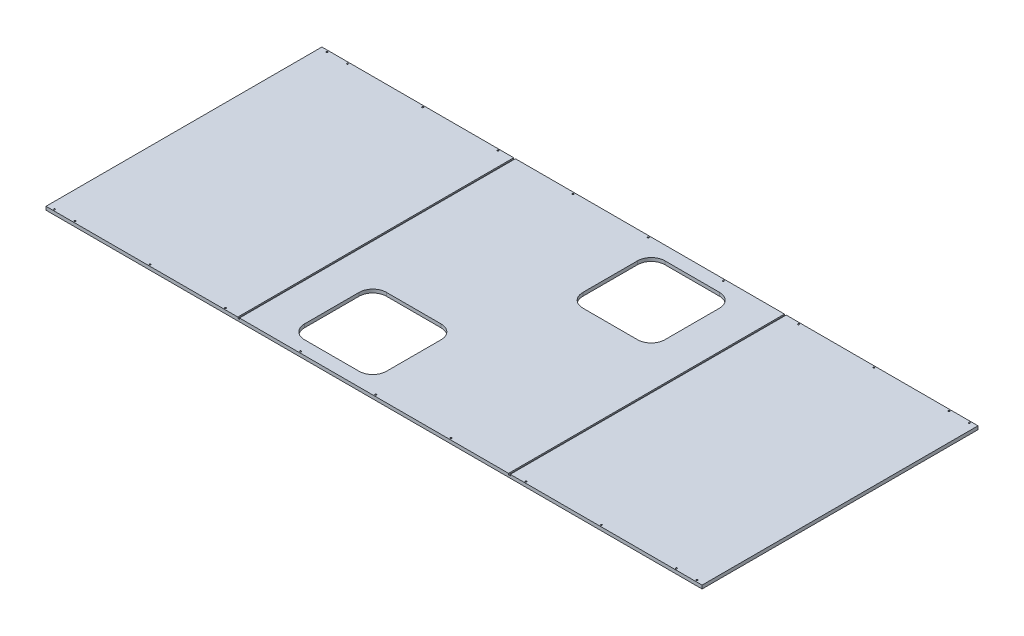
ISO-10303-21;
HEADER;
FILE_DESCRIPTION(('STEP AP214'),'2;1');
FILE_NAME('part.step','',(''),(''),'','','');
FILE_SCHEMA(('AUTOMOTIVE_DESIGN { 1 0 10303 214 1 1 1 1 }'));
ENDSEC;
DATA;
#1=APPLICATION_CONTEXT('core data for automotive mechanical design processes');
#2=APPLICATION_PROTOCOL_DEFINITION('international standard','automotive_design',2000,#1);
#3=PRODUCT_CONTEXT('',#1,'mechanical');
#4=PRODUCT('Part','Part','',(#3));
#5=PRODUCT_RELATED_PRODUCT_CATEGORY('part','',(#4));
#6=PRODUCT_DEFINITION_FORMATION('','',#4);
#7=PRODUCT_DEFINITION_CONTEXT('part definition',#1,'design');
#8=PRODUCT_DEFINITION('design','',#6,#7);
#9=PRODUCT_DEFINITION_SHAPE('','',#8);
#10=(LENGTH_UNIT() NAMED_UNIT(*) SI_UNIT(.MILLI.,.METRE.));
#11=(NAMED_UNIT(*) PLANE_ANGLE_UNIT() SI_UNIT($,.RADIAN.));
#12=(NAMED_UNIT(*) SI_UNIT($,.STERADIAN.) SOLID_ANGLE_UNIT());
#13=UNCERTAINTY_MEASURE_WITH_UNIT(LENGTH_MEASURE(1.E-05),#10,'distance_accuracy_value','');
#14=(GEOMETRIC_REPRESENTATION_CONTEXT(3) GLOBAL_UNCERTAINTY_ASSIGNED_CONTEXT((#13)) GLOBAL_UNIT_ASSIGNED_CONTEXT((#10,
#11,#12)) REPRESENTATION_CONTEXT('',''));
#15=CARTESIAN_POINT('',(0.,0.,0.));
#16=DIRECTION('',(0.,0.,1.));
#17=DIRECTION('',(1.,0.,0.));
#18=AXIS2_PLACEMENT_3D('',#15,#16,#17);
#19=CARTESIAN_POINT('',(-706.501,12.7,0.));
#20=DIRECTION('',(0.,-1.,0.));
#21=DIRECTION('',(0.,0.,-1.));
#22=AXIS2_PLACEMENT_3D('',#19,#20,#21);
#23=PLANE('',#22);
#24=CARTESIAN_POINT('',(1630.299,12.7,-1019.048));
#25=DIRECTION('',(0.,-1.,0.));
#26=DIRECTION('',(0.,0.,1.));
#27=AXIS2_PLACEMENT_3D('',#24,#25,#26);
#28=CIRCLE('',#27,2.80669999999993);
#29=CARTESIAN_POINT('',(1630.299,12.7,-1016.2413));
#30=VERTEX_POINT('',#29);
#31=EDGE_CURVE('E926',#30,#30,#28,.T.);
#32=ORIENTED_EDGE('',*,*,#31,.T.);
#33=EDGE_LOOP('',(#32));
#34=FACE_BOUND('',#33,.T.);
#35=CARTESIAN_POINT('',(1350.899,12.7,-1019.048));
#36=DIRECTION('',(0.,-1.,0.));
#37=DIRECTION('',(0.,0.,1.));
#38=AXIS2_PLACEMENT_3D('',#35,#36,#37);
#39=CIRCLE('',#38,2.8067);
#40=CARTESIAN_POINT('',(1350.899,12.7,-1016.2413));
#41=VERTEX_POINT('',#40);
#42=EDGE_CURVE('E931',#41,#41,#39,.T.);
#43=ORIENTED_EDGE('',*,*,#42,.T.);
#44=EDGE_LOOP('',(#43));
#45=FACE_BOUND('',#44,.T.);
#46=CARTESIAN_POINT('',(1071.499,12.7,-1019.048));
#47=DIRECTION('',(0.,-1.,0.));
#48=DIRECTION('',(0.,0.,1.));
#49=AXIS2_PLACEMENT_3D('',#46,#47,#48);
#50=CIRCLE('',#49,2.80669999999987);
#51=CARTESIAN_POINT('',(1071.499,12.7,-1016.2413));
#52=VERTEX_POINT('',#51);
#53=EDGE_CURVE('E937',#52,#52,#50,.T.);
#54=ORIENTED_EDGE('',*,*,#53,.T.);
#55=EDGE_LOOP('',(#54));
#56=FACE_BOUND('',#55,.T.);
#57=CARTESIAN_POINT('',(1706.499,12.7,-6.35000000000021));
#58=DIRECTION('',(0.,-1.,0.));
#59=DIRECTION('',(0.,0.,-1.));
#60=AXIS2_PLACEMENT_3D('',#57,#58,#59);
#61=CIRCLE('',#60,2.80669999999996);
#62=CARTESIAN_POINT('',(1706.499,12.7,-9.15670000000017));
#63=VERTEX_POINT('',#62);
#64=EDGE_CURVE('E969',#63,#63,#61,.T.);
#65=ORIENTED_EDGE('',*,*,#64,.T.);
#66=EDGE_LOOP('',(#65));
#67=FACE_BOUND('',#66,.T.);
#68=CARTESIAN_POINT('',(1071.499,12.7,-6.35000000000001));
#69=DIRECTION('',(0.,-1.,0.));
#70=DIRECTION('',(0.,0.,-1.));
#71=AXIS2_PLACEMENT_3D('',#68,#69,#70);
#72=CIRCLE('',#71,2.80669999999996);
#73=CARTESIAN_POINT('',(1071.499,12.7,-9.15669999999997));
#74=VERTEX_POINT('',#73);
#75=EDGE_CURVE('E1003',#74,#74,#72,.T.);
#76=ORIENTED_EDGE('',*,*,#75,.T.);
#77=EDGE_LOOP('',(#76));
#78=FACE_BOUND('',#77,.T.);
#79=CARTESIAN_POINT('',(1350.899,12.7,-6.34999999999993));
#80=DIRECTION('',(0.,-1.,0.));
#81=DIRECTION('',(0.,0.,-1.));
#82=AXIS2_PLACEMENT_3D('',#79,#80,#81);
#83=CIRCLE('',#82,2.80669999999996);
#84=CARTESIAN_POINT('',(1350.899,12.7,-9.15669999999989));
#85=VERTEX_POINT('',#84);
#86=EDGE_CURVE('E1009',#85,#85,#83,.T.);
#87=ORIENTED_EDGE('',*,*,#86,.T.);
#88=EDGE_LOOP('',(#87));
#89=FACE_BOUND('',#88,.T.);
#90=CARTESIAN_POINT('',(1630.299,12.7,-6.35000000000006));
#91=DIRECTION('',(0.,-1.,0.));
#92=DIRECTION('',(0.,0.,-1.));
#93=AXIS2_PLACEMENT_3D('',#90,#91,#92);
#94=CIRCLE('',#93,2.80669999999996);
#95=CARTESIAN_POINT('',(1630.299,12.7,-9.15670000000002));
#96=VERTEX_POINT('',#95);
#97=EDGE_CURVE('E540',#96,#96,#94,.T.);
#98=ORIENTED_EDGE('',*,*,#97,.T.);
#99=EDGE_LOOP('',(#98));
#100=FACE_BOUND('',#99,.T.);
#101=CARTESIAN_POINT('',(1706.499,12.7,-1019.048));
#102=DIRECTION('',(0.,-1.,0.));
#103=DIRECTION('',(0.,0.,1.));
#104=AXIS2_PLACEMENT_3D('',#101,#102,#103);
#105=CIRCLE('',#104,2.80669999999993);
#106=CARTESIAN_POINT('',(1706.499,12.7,-1016.2413));
#107=VERTEX_POINT('',#106);
#108=EDGE_CURVE('E261',#107,#107,#105,.T.);
#109=ORIENTED_EDGE('',*,*,#108,.T.);
#110=EDGE_LOOP('',(#109));
#111=FACE_BOUND('',#110,.T.);
#112=DIRECTION('',(-1.,0.,0.));
#113=VECTOR('',#112,1.);
#114=CARTESIAN_POINT('',(1025.398,12.7,-1025.398));
#115=LINE('',#114,#113);
#116=CARTESIAN_POINT('',(1731.899,12.7,-1025.398));
#117=VERTEX_POINT('',#116);
#118=CARTESIAN_POINT('',(1019.048,12.7,-1025.398));
#119=VERTEX_POINT('',#118);
#120=EDGE_CURVE('E403',#117,#119,#115,.T.);
#121=ORIENTED_EDGE('',*,*,#120,.T.);
#122=DIRECTION('',(0.,0.,1.));
#123=VECTOR('',#122,1.);
#124=CARTESIAN_POINT('',(1019.048,12.7,-2.70616862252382E-13));
#125=LINE('',#124,#123);
#126=CARTESIAN_POINT('',(1019.048,12.7,0.));
#127=VERTEX_POINT('',#126);
#128=EDGE_CURVE('E42',#119,#127,#125,.T.);
#129=ORIENTED_EDGE('',*,*,#128,.T.);
#130=DIRECTION('',(1.,0.,0.));
#131=VECTOR('',#130,1.);
#132=CARTESIAN_POINT('',(0.,12.7,0.));
#133=LINE('',#132,#131);
#134=CARTESIAN_POINT('',(1731.899,12.7,0.));
#135=VERTEX_POINT('',#134);
#136=EDGE_CURVE('E400',#127,#135,#133,.T.);
#137=ORIENTED_EDGE('',*,*,#136,.T.);
#138=DIRECTION('',(0.,0.,-1.));
#139=VECTOR('',#138,1.);
#140=CARTESIAN_POINT('',(1731.899,12.7,0.));
#141=LINE('',#140,#139);
#142=EDGE_CURVE('E398',#135,#117,#141,.T.);
#143=ORIENTED_EDGE('',*,*,#142,.T.);
#144=EDGE_LOOP('',(#121,#129,#137,#143));
#145=FACE_BOUND('',#144,.T.);
#146=ADVANCED_FACE('F34',(#34,#45,#56,#67,#78,#89,#100,#111,#145),#23,.F.);
#147=CARTESIAN_POINT('',(-681.101,12.7,-6.35000000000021));
#148=DIRECTION('',(0.,-1.,0.));
#149=DIRECTION('',(0.,0.,-1.));
#150=AXIS2_PLACEMENT_3D('',#147,#148,#149);
#151=CIRCLE('',#150,2.80669999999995);
#152=CARTESIAN_POINT('',(-681.101,12.7,-9.15670000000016));
#153=VERTEX_POINT('',#152);
#154=EDGE_CURVE('E920',#153,#153,#151,.T.);
#155=ORIENTED_EDGE('',*,*,#154,.T.);
#156=EDGE_LOOP('',(#155));
#157=FACE_BOUND('',#156,.T.);
#158=CARTESIAN_POINT('',(-604.900999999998,12.7,-1019.048));
#159=DIRECTION('',(0.,-1.,0.));
#160=DIRECTION('',(0.,0.,1.));
#161=AXIS2_PLACEMENT_3D('',#158,#159,#160);
#162=CIRCLE('',#161,2.80669999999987);
#163=CARTESIAN_POINT('',(-604.900999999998,12.7,-1016.2413));
#164=VERTEX_POINT('',#163);
#165=EDGE_CURVE('E943',#164,#164,#162,.T.);
#166=ORIENTED_EDGE('',*,*,#165,.T.);
#167=EDGE_LOOP('',(#166));
#168=FACE_BOUND('',#167,.T.);
#169=CARTESIAN_POINT('',(-325.500999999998,12.7,-1019.048));
#170=DIRECTION('',(0.,-1.,0.));
#171=DIRECTION('',(0.,0.,1.));
#172=AXIS2_PLACEMENT_3D('',#169,#170,#171);
#173=CIRCLE('',#172,2.8067);
#174=CARTESIAN_POINT('',(-325.500999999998,12.7,-1016.2413));
#175=VERTEX_POINT('',#174);
#176=EDGE_CURVE('E949',#175,#175,#173,.T.);
#177=ORIENTED_EDGE('',*,*,#176,.T.);
#178=EDGE_LOOP('',(#177));
#179=FACE_BOUND('',#178,.T.);
#180=CARTESIAN_POINT('',(-46.1009999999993,12.7,-1019.048));
#181=DIRECTION('',(0.,-1.,0.));
#182=DIRECTION('',(0.,0.,1.));
#183=AXIS2_PLACEMENT_3D('',#180,#181,#182);
#184=CIRCLE('',#183,2.8067);
#185=CARTESIAN_POINT('',(-46.1009999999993,12.7,-1016.2413));
#186=VERTEX_POINT('',#185);
#187=EDGE_CURVE('E955',#186,#186,#184,.T.);
#188=ORIENTED_EDGE('',*,*,#187,.T.);
#189=EDGE_LOOP('',(#188));
#190=FACE_BOUND('',#189,.T.);
#191=CARTESIAN_POINT('',(-46.1010000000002,12.7,-6.35000000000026));
#192=DIRECTION('',(0.,-1.,0.));
#193=DIRECTION('',(0.,0.,-1.));
#194=AXIS2_PLACEMENT_3D('',#191,#192,#193);
#195=CIRCLE('',#194,2.80669999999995);
#196=CARTESIAN_POINT('',(-46.1010000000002,12.7,-9.15670000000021));
#197=VERTEX_POINT('',#196);
#198=EDGE_CURVE('E979',#197,#197,#195,.T.);
#199=ORIENTED_EDGE('',*,*,#198,.T.);
#200=EDGE_LOOP('',(#199));
#201=FACE_BOUND('',#200,.T.);
#202=CARTESIAN_POINT('',(-325.501,12.7,-6.35000000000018));
#203=DIRECTION('',(0.,-1.,0.));
#204=DIRECTION('',(0.,0.,-1.));
#205=AXIS2_PLACEMENT_3D('',#202,#203,#204);
#206=CIRCLE('',#205,2.80669999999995);
#207=CARTESIAN_POINT('',(-325.501,12.7,-9.15670000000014));
#208=VERTEX_POINT('',#207);
#209=EDGE_CURVE('E985',#208,#208,#206,.T.);
#210=ORIENTED_EDGE('',*,*,#209,.T.);
#211=EDGE_LOOP('',(#210));
#212=FACE_BOUND('',#211,.T.);
#213=CARTESIAN_POINT('',(-681.100999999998,12.7,-1019.048));
#214=DIRECTION('',(0.,-1.,0.));
#215=DIRECTION('',(0.,0.,1.));
#216=AXIS2_PLACEMENT_3D('',#213,#214,#215);
#217=CIRCLE('',#216,2.80669999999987);
#218=CARTESIAN_POINT('',(-681.100999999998,12.7,-1016.2413));
#219=VERTEX_POINT('',#218);
#220=EDGE_CURVE('E991',#219,#219,#217,.T.);
#221=ORIENTED_EDGE('',*,*,#220,.T.);
#222=EDGE_LOOP('',(#221));
#223=FACE_BOUND('',#222,.T.);
#224=CARTESIAN_POINT('',(-604.901,12.7,-6.35000000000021));
#225=DIRECTION('',(0.,-1.,0.));
#226=DIRECTION('',(0.,0.,-1.));
#227=AXIS2_PLACEMENT_3D('',#224,#225,#226);
#228=CIRCLE('',#227,2.80669999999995);
#229=CARTESIAN_POINT('',(-604.901,12.7,-9.15670000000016));
#230=VERTEX_POINT('',#229);
#231=EDGE_CURVE('E997',#230,#230,#228,.T.);
#232=ORIENTED_EDGE('',*,*,#231,.T.);
#233=EDGE_LOOP('',(#232));
#234=FACE_BOUND('',#233,.T.);
#235=CARTESIAN_POINT('',(-706.501,12.7,0.));
#236=VERTEX_POINT('',#235);
#237=CARTESIAN_POINT('',(6.34999999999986,12.7,0.));
#238=VERTEX_POINT('',#237);
#239=EDGE_CURVE('E395',#236,#238,#133,.T.);
#240=ORIENTED_EDGE('',*,*,#239,.T.);
#241=DIRECTION('',(0.,0.,-1.));
#242=VECTOR('',#241,1.);
#243=CARTESIAN_POINT('',(6.3500000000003,12.7,0.));
#244=LINE('',#243,#242);
#245=CARTESIAN_POINT('',(6.34999999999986,12.7,-1025.398));
#246=VERTEX_POINT('',#245);
#247=EDGE_CURVE('E433',#238,#246,#244,.T.);
#248=ORIENTED_EDGE('',*,*,#247,.T.);
#249=CARTESIAN_POINT('',(-706.501,12.7,-1025.398));
#250=VERTEX_POINT('',#249);
#251=EDGE_CURVE('E402',#246,#250,#115,.T.);
#252=ORIENTED_EDGE('',*,*,#251,.T.);
#253=DIRECTION('',(0.,0.,1.));
#254=VECTOR('',#253,1.);
#255=CARTESIAN_POINT('',(-706.501,12.7,0.));
#256=LINE('',#255,#254);
#257=EDGE_CURVE('E406',#250,#236,#256,.T.);
#258=ORIENTED_EDGE('',*,*,#257,.T.);
#259=EDGE_LOOP('',(#240,#248,#252,#258));
#260=FACE_BOUND('',#259,.T.);
#261=ADVANCED_FACE('F468',(#157,#168,#179,#190,#201,#212,#223,#234,#260),#23,.F.);
#262=CARTESIAN_POINT('',(1025.398,12.7,0.));
#263=DIRECTION('',(0.,0.,-1.));
#264=DIRECTION('',(-1.,0.,0.));
#265=AXIS2_PLACEMENT_3D('',#262,#263,#264);
#266=PLANE('',#265);
#267=ORIENTED_EDGE('',*,*,#136,.F.);
#268=DIRECTION('',(0.,-1.,0.));
#269=VECTOR('',#268,1.);
#270=CARTESIAN_POINT('',(1019.048,12.7,0.));
#271=LINE('',#270,#269);
#272=CARTESIAN_POINT('',(1019.048,7.9375,0.));
#273=VERTEX_POINT('',#272);
#274=EDGE_CURVE('E369',#127,#273,#271,.T.);
#275=ORIENTED_EDGE('',*,*,#274,.T.);
#276=DIRECTION('',(1.,0.,0.));
#277=VECTOR('',#276,1.);
#278=CARTESIAN_POINT('',(1025.398,7.9375,0.));
#279=LINE('',#278,#277);
#280=CARTESIAN_POINT('',(1012.698,7.9375,0.));
#281=VERTEX_POINT('',#280);
#282=EDGE_CURVE('E372',#281,#273,#279,.T.);
#283=ORIENTED_EDGE('',*,*,#282,.F.);
#284=DIRECTION('',(0.,1.,0.));
#285=VECTOR('',#284,1.);
#286=CARTESIAN_POINT('',(1012.698,12.7,0.));
#287=LINE('',#286,#285);
#288=CARTESIAN_POINT('',(1012.698,12.7,0.));
#289=VERTEX_POINT('',#288);
#290=EDGE_CURVE('E363',#281,#289,#287,.T.);
#291=ORIENTED_EDGE('',*,*,#290,.T.);
#292=CARTESIAN_POINT('',(12.7000000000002,12.7,0.));
#293=VERTEX_POINT('',#292);
#294=EDGE_CURVE('E399',#293,#289,#133,.T.);
#295=ORIENTED_EDGE('',*,*,#294,.F.);
#296=DIRECTION('',(0.,-1.,0.));
#297=VECTOR('',#296,1.);
#298=CARTESIAN_POINT('',(12.7000000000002,12.7,0.));
#299=LINE('',#298,#297);
#300=CARTESIAN_POINT('',(12.7000000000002,7.9375,0.));
#301=VERTEX_POINT('',#300);
#302=EDGE_CURVE('E383',#293,#301,#299,.T.);
#303=ORIENTED_EDGE('',*,*,#302,.T.);
#304=DIRECTION('',(1.,0.,0.));
#305=VECTOR('',#304,1.);
#306=CARTESIAN_POINT('',(1025.398,7.9375,0.));
#307=LINE('',#306,#305);
#308=CARTESIAN_POINT('',(6.34999999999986,7.9375,0.));
#309=VERTEX_POINT('',#308);
#310=EDGE_CURVE('E392',#309,#301,#307,.T.);
#311=ORIENTED_EDGE('',*,*,#310,.F.);
#312=DIRECTION('',(0.,1.,0.));
#313=VECTOR('',#312,1.);
#314=CARTESIAN_POINT('',(6.3500000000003,12.7,0.));
#315=LINE('',#314,#313);
#316=EDGE_CURVE('E389',#309,#238,#315,.T.);
#317=ORIENTED_EDGE('',*,*,#316,.T.);
#318=ORIENTED_EDGE('',*,*,#239,.F.);
#319=DIRECTION('',(0.,-1.,0.));
#320=VECTOR('',#319,1.);
#321=CARTESIAN_POINT('',(-706.501,12.7,0.));
#322=LINE('',#321,#320);
#323=CARTESIAN_POINT('',(-706.501,0.,0.));
#324=VERTEX_POINT('',#323);
#325=EDGE_CURVE('E409',#236,#324,#322,.T.);
#326=ORIENTED_EDGE('',*,*,#325,.T.);
#327=DIRECTION('',(1.,0.,0.));
#328=VECTOR('',#327,1.);
#329=CARTESIAN_POINT('',(1025.398,0.,0.));
#330=LINE('',#329,#328);
#331=CARTESIAN_POINT('',(1731.899,0.,0.));
#332=VERTEX_POINT('',#331);
#333=EDGE_CURVE('E394',#324,#332,#330,.T.);
#334=ORIENTED_EDGE('',*,*,#333,.T.);
#335=DIRECTION('',(0.,-1.,0.));
#336=VECTOR('',#335,1.);
#337=CARTESIAN_POINT('',(1731.899,12.7,0.));
#338=LINE('',#337,#336);
#339=EDGE_CURVE('E427',#135,#332,#338,.T.);
#340=ORIENTED_EDGE('',*,*,#339,.F.);
#341=EDGE_LOOP('',(#267,#275,#283,#291,#295,#303,#311,#317,#318,#326,#334,#340));
#342=FACE_BOUND('',#341,.T.);
#343=ADVANCED_FACE('F36',(#342),#266,.F.);
#344=CARTESIAN_POINT('',(1731.899,12.7,0.));
#345=DIRECTION('',(-1.,0.,0.));
#346=DIRECTION('',(0.,0.,1.));
#347=AXIS2_PLACEMENT_3D('',#344,#345,#346);
#348=PLANE('',#347);
#349=DIRECTION('',(0.,0.,-1.));
#350=VECTOR('',#349,1.);
#351=CARTESIAN_POINT('',(1731.899,0.,0.));
#352=LINE('',#351,#350);
#353=CARTESIAN_POINT('',(1731.899,0.,-1025.398));
#354=VERTEX_POINT('',#353);
#355=EDGE_CURVE('E411',#332,#354,#352,.T.);
#356=ORIENTED_EDGE('',*,*,#355,.T.);
#357=DIRECTION('',(0.,-1.,0.));
#358=VECTOR('',#357,1.);
#359=CARTESIAN_POINT('',(1731.899,12.7,-1025.398));
#360=LINE('',#359,#358);
#361=EDGE_CURVE('E424',#117,#354,#360,.T.);
#362=ORIENTED_EDGE('',*,*,#361,.F.);
#363=ORIENTED_EDGE('',*,*,#142,.F.);
#364=ORIENTED_EDGE('',*,*,#339,.T.);
#365=EDGE_LOOP('',(#356,#362,#363,#364));
#366=FACE_BOUND('',#365,.T.);
#367=ADVANCED_FACE('F566',(#366),#348,.F.);
#368=CARTESIAN_POINT('',(0.,12.7,-1025.398));
#369=DIRECTION('',(0.,0.,1.));
#370=DIRECTION('',(1.,0.,0.));
#371=AXIS2_PLACEMENT_3D('',#368,#369,#370);
#372=PLANE('',#371);
#373=DIRECTION('',(-1.,0.,0.));
#374=VECTOR('',#373,1.);
#375=CARTESIAN_POINT('',(0.,7.9375,-1025.398));
#376=LINE('',#375,#374);
#377=CARTESIAN_POINT('',(1019.048,7.9375,-1025.398));
#378=VERTEX_POINT('',#377);
#379=CARTESIAN_POINT('',(1012.698,7.9375,-1025.398));
#380=VERTEX_POINT('',#379);
#381=EDGE_CURVE('E11',#378,#380,#376,.T.);
#382=ORIENTED_EDGE('',*,*,#381,.F.);
#383=DIRECTION('',(0.,1.,0.));
#384=VECTOR('',#383,1.);
#385=CARTESIAN_POINT('',(1019.048,12.7,-1025.398));
#386=LINE('',#385,#384);
#387=EDGE_CURVE('E366',#378,#119,#386,.T.);
#388=ORIENTED_EDGE('',*,*,#387,.T.);
#389=ORIENTED_EDGE('',*,*,#120,.F.);
#390=ORIENTED_EDGE('',*,*,#361,.T.);
#391=DIRECTION('',(-1.,0.,0.));
#392=VECTOR('',#391,1.);
#393=CARTESIAN_POINT('',(0.,0.,-1025.398));
#394=LINE('',#393,#392);
#395=CARTESIAN_POINT('',(-706.501,0.,-1025.398));
#396=VERTEX_POINT('',#395);
#397=EDGE_CURVE('E414',#354,#396,#394,.T.);
#398=ORIENTED_EDGE('',*,*,#397,.T.);
#399=DIRECTION('',(0.,-1.,0.));
#400=VECTOR('',#399,1.);
#401=CARTESIAN_POINT('',(-706.501,12.7,-1025.398));
#402=LINE('',#401,#400);
#403=EDGE_CURVE('E421',#250,#396,#402,.T.);
#404=ORIENTED_EDGE('',*,*,#403,.F.);
#405=ORIENTED_EDGE('',*,*,#251,.F.);
#406=DIRECTION('',(0.,-1.,0.));
#407=VECTOR('',#406,1.);
#408=CARTESIAN_POINT('',(6.34999999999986,12.7,-1025.398));
#409=LINE('',#408,#407);
#410=CARTESIAN_POINT('',(6.34999999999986,7.9375,-1025.398));
#411=VERTEX_POINT('',#410);
#412=EDGE_CURVE('E386',#246,#411,#409,.T.);
#413=ORIENTED_EDGE('',*,*,#412,.T.);
#414=DIRECTION('',(-1.,0.,0.));
#415=VECTOR('',#414,1.);
#416=CARTESIAN_POINT('',(0.,7.9375,-1025.398));
#417=LINE('',#416,#415);
#418=CARTESIAN_POINT('',(12.7000000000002,7.9375,-1025.398));
#419=VERTEX_POINT('',#418);
#420=EDGE_CURVE('E436',#419,#411,#417,.T.);
#421=ORIENTED_EDGE('',*,*,#420,.F.);
#422=DIRECTION('',(0.,1.,0.));
#423=VECTOR('',#422,1.);
#424=CARTESIAN_POINT('',(12.7000000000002,12.7,-1025.398));
#425=LINE('',#424,#423);
#426=CARTESIAN_POINT('',(12.7000000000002,12.7,-1025.398));
#427=VERTEX_POINT('',#426);
#428=EDGE_CURVE('E380',#419,#427,#425,.T.);
#429=ORIENTED_EDGE('',*,*,#428,.T.);
#430=CARTESIAN_POINT('',(1012.698,12.7,-1025.398));
#431=VERTEX_POINT('',#430);
#432=EDGE_CURVE('E407',#431,#427,#115,.T.);
#433=ORIENTED_EDGE('',*,*,#432,.F.);
#434=DIRECTION('',(0.,-1.,0.));
#435=VECTOR('',#434,1.);
#436=CARTESIAN_POINT('',(1012.698,12.7,-1025.398));
#437=LINE('',#436,#435);
#438=EDGE_CURVE('E360',#431,#380,#437,.T.);
#439=ORIENTED_EDGE('',*,*,#438,.T.);
#440=EDGE_LOOP('',(#382,#388,#389,#390,#398,#404,#405,#413,#421,#429,#433,#439));
#441=FACE_BOUND('',#440,.T.);
#442=ADVANCED_FACE('F463',(#441),#372,.F.);
#443=CARTESIAN_POINT('',(-706.501,12.7,0.));
#444=DIRECTION('',(1.,0.,0.));
#445=DIRECTION('',(0.,0.,-1.));
#446=AXIS2_PLACEMENT_3D('',#443,#444,#445);
#447=PLANE('',#446);
#448=DIRECTION('',(0.,0.,1.));
#449=VECTOR('',#448,1.);
#450=CARTESIAN_POINT('',(-706.501,0.,0.));
#451=LINE('',#450,#449);
#452=EDGE_CURVE('E416',#396,#324,#451,.T.);
#453=ORIENTED_EDGE('',*,*,#452,.T.);
#454=ORIENTED_EDGE('',*,*,#325,.F.);
#455=ORIENTED_EDGE('',*,*,#257,.F.);
#456=ORIENTED_EDGE('',*,*,#403,.T.);
#457=EDGE_LOOP('',(#453,#454,#455,#456));
#458=FACE_BOUND('',#457,.T.);
#459=ADVANCED_FACE('F473',(#458),#447,.F.);
#460=CARTESIAN_POINT('',(512.699,12.7,-6.35000000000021));
#461=DIRECTION('',(0.,-1.,0.));
#462=DIRECTION('',(0.,0.,-1.));
#463=AXIS2_PLACEMENT_3D('',#460,#461,#462);
#464=CIRCLE('',#463,2.80669999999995);
#465=CARTESIAN_POINT('',(512.699,12.7,-9.15670000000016));
#466=VERTEX_POINT('',#465);
#467=EDGE_CURVE('E515',#466,#466,#464,.T.);
#468=ORIENTED_EDGE('',*,*,#467,.T.);
#469=EDGE_LOOP('',(#468));
#470=FACE_BOUND('',#469,.T.);
#471=CARTESIAN_POINT('',(233.299000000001,12.7,-1019.048));
#472=DIRECTION('',(0.,-1.,0.));
#473=DIRECTION('',(0.,0.,1.));
#474=AXIS2_PLACEMENT_3D('',#471,#472,#473);
#475=CIRCLE('',#474,2.80669999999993);
#476=CARTESIAN_POINT('',(233.299000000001,12.7,-1016.2413));
#477=VERTEX_POINT('',#476);
#478=EDGE_CURVE('E519',#477,#477,#475,.T.);
#479=ORIENTED_EDGE('',*,*,#478,.T.);
#480=EDGE_LOOP('',(#479));
#481=FACE_BOUND('',#480,.T.);
#482=CARTESIAN_POINT('',(792.098999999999,12.7,-6.35000000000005));
#483=DIRECTION('',(0.,-1.,0.));
#484=DIRECTION('',(0.,0.,-1.));
#485=AXIS2_PLACEMENT_3D('',#482,#483,#484);
#486=CIRCLE('',#485,2.80669999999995);
#487=CARTESIAN_POINT('',(792.098999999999,12.7,-9.1567));
#488=VERTEX_POINT('',#487);
#489=EDGE_CURVE('E523',#488,#488,#486,.T.);
#490=ORIENTED_EDGE('',*,*,#489,.T.);
#491=EDGE_LOOP('',(#490));
#492=FACE_BOUND('',#491,.T.);
#493=CARTESIAN_POINT('',(233.299,12.7,-6.3500000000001));
#494=DIRECTION('',(0.,-1.,0.));
#495=DIRECTION('',(0.,0.,-1.));
#496=AXIS2_PLACEMENT_3D('',#493,#494,#495);
#497=CIRCLE('',#496,2.80669999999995);
#498=CARTESIAN_POINT('',(233.299,12.7,-9.15670000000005));
#499=VERTEX_POINT('',#498);
#500=EDGE_CURVE('E527',#499,#499,#497,.T.);
#501=ORIENTED_EDGE('',*,*,#500,.T.);
#502=EDGE_LOOP('',(#501));
#503=FACE_BOUND('',#502,.T.);
#504=CARTESIAN_POINT('',(792.099,12.7,-1019.048));
#505=DIRECTION('',(0.,-1.,0.));
#506=DIRECTION('',(0.,0.,1.));
#507=AXIS2_PLACEMENT_3D('',#504,#505,#506);
#508=CIRCLE('',#507,2.8067);
#509=CARTESIAN_POINT('',(792.099,12.7,-1016.2413));
#510=VERTEX_POINT('',#509);
#511=EDGE_CURVE('E531',#510,#510,#508,.T.);
#512=ORIENTED_EDGE('',*,*,#511,.T.);
#513=EDGE_LOOP('',(#512));
#514=FACE_BOUND('',#513,.T.);
#515=CARTESIAN_POINT('',(512.699,12.7,-1019.048));
#516=DIRECTION('',(0.,-1.,0.));
#517=DIRECTION('',(0.,0.,1.));
#518=AXIS2_PLACEMENT_3D('',#515,#516,#517);
#519=CIRCLE('',#518,2.80669999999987);
#520=CARTESIAN_POINT('',(512.699,12.7,-1016.2413));
#521=VERTEX_POINT('',#520);
#522=EDGE_CURVE('E534',#521,#521,#519,.T.);
#523=ORIENTED_EDGE('',*,*,#522,.T.);
#524=EDGE_LOOP('',(#523));
#525=FACE_BOUND('',#524,.T.);
#526=DIRECTION('',(1.,0.,0.));
#527=VECTOR('',#526,1.);
#528=CARTESIAN_POINT('',(203.2,12.7,-355.6));
#529=LINE('',#528,#527);
#530=CARTESIAN_POINT('',(203.2,12.7,-355.6));
#531=VERTEX_POINT('',#530);
#532=CARTESIAN_POINT('',(406.4,12.7,-355.6));
#533=VERTEX_POINT('',#532);
#534=EDGE_CURVE('E226',#531,#533,#529,.T.);
#535=ORIENTED_EDGE('',*,*,#534,.T.);
#536=CARTESIAN_POINT('',(406.4,12.7,-304.8));
#537=DIRECTION('',(0.,-1.,0.));
#538=DIRECTION('',(0.,0.,-1.));
#539=AXIS2_PLACEMENT_3D('',#536,#537,#538);
#540=CIRCLE('',#539,50.8);
#541=CARTESIAN_POINT('',(457.2,12.7,-304.8));
#542=VERTEX_POINT('',#541);
#543=EDGE_CURVE('E220',#533,#542,#540,.T.);
#544=ORIENTED_EDGE('',*,*,#543,.T.);
#545=DIRECTION('',(0.,0.,1.));
#546=VECTOR('',#545,1.);
#547=CARTESIAN_POINT('',(457.2,12.7,-101.6));
#548=LINE('',#547,#546);
#549=CARTESIAN_POINT('',(457.2,12.7,-101.6));
#550=VERTEX_POINT('',#549);
#551=EDGE_CURVE('E229',#542,#550,#548,.T.);
#552=ORIENTED_EDGE('',*,*,#551,.T.);
#553=CARTESIAN_POINT('',(406.4,12.7,-101.6));
#554=DIRECTION('',(0.,-1.,0.));
#555=DIRECTION('',(0.,0.,1.));
#556=AXIS2_PLACEMENT_3D('',#553,#554,#555);
#557=CIRCLE('',#556,50.8);
#558=CARTESIAN_POINT('',(406.4,12.7,-50.8));
#559=VERTEX_POINT('',#558);
#560=EDGE_CURVE('E49',#550,#559,#557,.T.);
#561=ORIENTED_EDGE('',*,*,#560,.T.);
#562=DIRECTION('',(-1.,0.,0.));
#563=VECTOR('',#562,1.);
#564=CARTESIAN_POINT('',(203.2,12.7,-50.8));
#565=LINE('',#564,#563);
#566=CARTESIAN_POINT('',(203.2,12.7,-50.8));
#567=VERTEX_POINT('',#566);
#568=EDGE_CURVE('E247',#559,#567,#565,.T.);
#569=ORIENTED_EDGE('',*,*,#568,.T.);
#570=CARTESIAN_POINT('',(203.2,12.7,-101.6));
#571=DIRECTION('',(0.,-1.,0.));
#572=DIRECTION('',(0.,0.,-1.));
#573=AXIS2_PLACEMENT_3D('',#570,#571,#572);
#574=CIRCLE('',#573,50.8);
#575=CARTESIAN_POINT('',(152.4,12.7,-101.6));
#576=VERTEX_POINT('',#575);
#577=EDGE_CURVE('E250',#567,#576,#574,.T.);
#578=ORIENTED_EDGE('',*,*,#577,.T.);
#579=DIRECTION('',(0.,0.,-1.));
#580=VECTOR('',#579,1.);
#581=CARTESIAN_POINT('',(152.4,12.7,-101.6));
#582=LINE('',#581,#580);
#583=CARTESIAN_POINT('',(152.4,12.7,-304.8));
#584=VERTEX_POINT('',#583);
#585=EDGE_CURVE('E253',#576,#584,#582,.T.);
#586=ORIENTED_EDGE('',*,*,#585,.T.);
#587=CARTESIAN_POINT('',(203.2,12.7,-304.8));
#588=DIRECTION('',(0.,-1.,0.));
#589=DIRECTION('',(0.,0.,-1.));
#590=AXIS2_PLACEMENT_3D('',#587,#588,#589);
#591=CIRCLE('',#590,50.8);
#592=EDGE_CURVE('E256',#584,#531,#591,.T.);
#593=ORIENTED_EDGE('',*,*,#592,.T.);
#594=EDGE_LOOP('',(#535,#544,#552,#561,#569,#578,#586,#593));
#595=FACE_BOUND('',#594,.T.);
#596=DIRECTION('',(0.,0.,1.));
#597=VECTOR('',#596,1.);
#598=CARTESIAN_POINT('',(872.998,12.7,-720.598));
#599=LINE('',#598,#597);
#600=CARTESIAN_POINT('',(872.998,12.7,-923.797999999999));
#601=VERTEX_POINT('',#600);
#602=CARTESIAN_POINT('',(872.998,12.7,-720.598));
#603=VERTEX_POINT('',#602);
#604=EDGE_CURVE('E313',#601,#603,#599,.T.);
#605=ORIENTED_EDGE('',*,*,#604,.T.);
#606=CARTESIAN_POINT('',(822.198,12.7,-720.598));
#607=DIRECTION('',(0.,-1.,0.));
#608=DIRECTION('',(0.,0.,1.));
#609=AXIS2_PLACEMENT_3D('',#606,#607,#608);
#610=CIRCLE('',#609,50.8);
#611=CARTESIAN_POINT('',(822.197999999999,12.7,-669.798));
#612=VERTEX_POINT('',#611);
#613=EDGE_CURVE('E291',#603,#612,#610,.T.);
#614=ORIENTED_EDGE('',*,*,#613,.T.);
#615=DIRECTION('',(-1.,0.,0.));
#616=VECTOR('',#615,1.);
#617=CARTESIAN_POINT('',(618.998,12.7,-669.798));
#618=LINE('',#617,#616);
#619=CARTESIAN_POINT('',(618.998,12.7,-669.798));
#620=VERTEX_POINT('',#619);
#621=EDGE_CURVE('E294',#612,#620,#618,.T.);
#622=ORIENTED_EDGE('',*,*,#621,.T.);
#623=CARTESIAN_POINT('',(618.998,12.7,-720.598));
#624=DIRECTION('',(0.,-1.,0.));
#625=DIRECTION('',(0.,0.,-1.));
#626=AXIS2_PLACEMENT_3D('',#623,#624,#625);
#627=CIRCLE('',#626,50.8);
#628=CARTESIAN_POINT('',(568.198,12.7,-720.598));
#629=VERTEX_POINT('',#628);
#630=EDGE_CURVE('E298',#620,#629,#627,.T.);
#631=ORIENTED_EDGE('',*,*,#630,.T.);
#632=DIRECTION('',(0.,0.,-1.));
#633=VECTOR('',#632,1.);
#634=CARTESIAN_POINT('',(568.198,12.7,-720.598));
#635=LINE('',#634,#633);
#636=CARTESIAN_POINT('',(568.198,12.7,-923.797999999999));
#637=VERTEX_POINT('',#636);
#638=EDGE_CURVE('E301',#629,#637,#635,.T.);
#639=ORIENTED_EDGE('',*,*,#638,.T.);
#640=CARTESIAN_POINT('',(618.998,12.7,-923.798));
#641=DIRECTION('',(0.,-1.,0.));
#642=DIRECTION('',(0.,0.,-1.));
#643=AXIS2_PLACEMENT_3D('',#640,#641,#642);
#644=CIRCLE('',#643,50.8);
#645=CARTESIAN_POINT('',(618.998,12.7,-974.598));
#646=VERTEX_POINT('',#645);
#647=EDGE_CURVE('E304',#637,#646,#644,.T.);
#648=ORIENTED_EDGE('',*,*,#647,.T.);
#649=DIRECTION('',(1.,0.,0.));
#650=VECTOR('',#649,1.);
#651=CARTESIAN_POINT('',(618.998,12.7,-974.598));
#652=LINE('',#651,#650);
#653=CARTESIAN_POINT('',(822.197999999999,12.7,-974.598));
#654=VERTEX_POINT('',#653);
#655=EDGE_CURVE('E307',#646,#654,#652,.T.);
#656=ORIENTED_EDGE('',*,*,#655,.T.);
#657=CARTESIAN_POINT('',(822.198,12.7,-923.798));
#658=DIRECTION('',(0.,-1.,0.));
#659=DIRECTION('',(0.,0.,-1.));
#660=AXIS2_PLACEMENT_3D('',#657,#658,#659);
#661=CIRCLE('',#660,50.8);
#662=EDGE_CURVE('E310',#654,#601,#661,.T.);
#663=ORIENTED_EDGE('',*,*,#662,.T.);
#664=EDGE_LOOP('',(#605,#614,#622,#631,#639,#648,#656,#663));
#665=FACE_BOUND('',#664,.T.);
#666=ORIENTED_EDGE('',*,*,#294,.T.);
#667=DIRECTION('',(0.,0.,-1.));
#668=VECTOR('',#667,1.);
#669=CARTESIAN_POINT('',(1012.698,12.7,0.));
#670=LINE('',#669,#668);
#671=EDGE_CURVE('E438',#289,#431,#670,.T.);
#672=ORIENTED_EDGE('',*,*,#671,.T.);
#673=ORIENTED_EDGE('',*,*,#432,.T.);
#674=DIRECTION('',(0.,0.,1.));
#675=VECTOR('',#674,1.);
#676=CARTESIAN_POINT('',(12.7000000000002,12.7,0.));
#677=LINE('',#676,#675);
#678=EDGE_CURVE('E430',#427,#293,#677,.T.);
#679=ORIENTED_EDGE('',*,*,#678,.T.);
#680=EDGE_LOOP('',(#666,#672,#673,#679));
#681=FACE_BOUND('',#680,.T.);
#682=ADVANCED_FACE('F233',(#470,#481,#492,#503,#514,#525,#595,#665,#681),#23,.F.);
#683=CARTESIAN_POINT('',(-706.501,0.,0.));
#684=DIRECTION('',(0.,-1.,0.));
#685=DIRECTION('',(0.,0.,-1.));
#686=AXIS2_PLACEMENT_3D('',#683,#684,#685);
#687=PLANE('',#686);
#688=CARTESIAN_POINT('',(512.699,0.,-6.35000000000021));
#689=DIRECTION('',(0.,-1.,0.));
#690=DIRECTION('',(0.,0.,-1.));
#691=AXIS2_PLACEMENT_3D('',#688,#689,#690);
#692=CIRCLE('',#691,2.80669999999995);
#693=CARTESIAN_POINT('',(512.699,0.,-9.15670000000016));
#694=VERTEX_POINT('',#693);
#695=EDGE_CURVE('E915',#694,#694,#692,.T.);
#696=ORIENTED_EDGE('',*,*,#695,.F.);
#697=EDGE_LOOP('',(#696));
#698=FACE_BOUND('',#697,.T.);
#699=CARTESIAN_POINT('',(-681.101,0.,-6.35000000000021));
#700=DIRECTION('',(0.,-1.,0.));
#701=DIRECTION('',(0.,0.,-1.));
#702=AXIS2_PLACEMENT_3D('',#699,#700,#701);
#703=CIRCLE('',#702,2.80669999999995);
#704=CARTESIAN_POINT('',(-681.101,0.,-9.15670000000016));
#705=VERTEX_POINT('',#704);
#706=EDGE_CURVE('E917',#705,#705,#703,.T.);
#707=ORIENTED_EDGE('',*,*,#706,.F.);
#708=EDGE_LOOP('',(#707));
#709=FACE_BOUND('',#708,.T.);
#710=CARTESIAN_POINT('',(1630.299,0.,-1019.048));
#711=DIRECTION('',(0.,-1.,0.));
#712=DIRECTION('',(0.,0.,1.));
#713=AXIS2_PLACEMENT_3D('',#710,#711,#712);
#714=CIRCLE('',#713,2.80669999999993);
#715=CARTESIAN_POINT('',(1630.299,0.,-1016.2413));
#716=VERTEX_POINT('',#715);
#717=EDGE_CURVE('E923',#716,#716,#714,.T.);
#718=ORIENTED_EDGE('',*,*,#717,.F.);
#719=EDGE_LOOP('',(#718));
#720=FACE_BOUND('',#719,.T.);
#721=CARTESIAN_POINT('',(1350.899,0.,-1019.048));
#722=DIRECTION('',(0.,-1.,0.));
#723=DIRECTION('',(0.,0.,1.));
#724=AXIS2_PLACEMENT_3D('',#721,#722,#723);
#725=CIRCLE('',#724,2.8067);
#726=CARTESIAN_POINT('',(1350.899,0.,-1016.2413));
#727=VERTEX_POINT('',#726);
#728=EDGE_CURVE('E928',#727,#727,#725,.T.);
#729=ORIENTED_EDGE('',*,*,#728,.F.);
#730=EDGE_LOOP('',(#729));
#731=FACE_BOUND('',#730,.T.);
#732=CARTESIAN_POINT('',(1071.499,0.,-1019.048));
#733=DIRECTION('',(0.,-1.,0.));
#734=DIRECTION('',(0.,0.,1.));
#735=AXIS2_PLACEMENT_3D('',#732,#733,#734);
#736=CIRCLE('',#735,2.80669999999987);
#737=CARTESIAN_POINT('',(1071.499,0.,-1016.2413));
#738=VERTEX_POINT('',#737);
#739=EDGE_CURVE('E934',#738,#738,#736,.T.);
#740=ORIENTED_EDGE('',*,*,#739,.F.);
#741=EDGE_LOOP('',(#740));
#742=FACE_BOUND('',#741,.T.);
#743=CARTESIAN_POINT('',(-604.900999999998,0.,-1019.048));
#744=DIRECTION('',(0.,-1.,0.));
#745=DIRECTION('',(0.,0.,1.));
#746=AXIS2_PLACEMENT_3D('',#743,#744,#745);
#747=CIRCLE('',#746,2.80669999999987);
#748=CARTESIAN_POINT('',(-604.900999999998,0.,-1016.2413));
#749=VERTEX_POINT('',#748);
#750=EDGE_CURVE('E940',#749,#749,#747,.T.);
#751=ORIENTED_EDGE('',*,*,#750,.F.);
#752=EDGE_LOOP('',(#751));
#753=FACE_BOUND('',#752,.T.);
#754=CARTESIAN_POINT('',(-325.500999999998,0.,-1019.048));
#755=DIRECTION('',(0.,-1.,0.));
#756=DIRECTION('',(0.,0.,1.));
#757=AXIS2_PLACEMENT_3D('',#754,#755,#756);
#758=CIRCLE('',#757,2.8067);
#759=CARTESIAN_POINT('',(-325.500999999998,0.,-1016.2413));
#760=VERTEX_POINT('',#759);
#761=EDGE_CURVE('E946',#760,#760,#758,.T.);
#762=ORIENTED_EDGE('',*,*,#761,.F.);
#763=EDGE_LOOP('',(#762));
#764=FACE_BOUND('',#763,.T.);
#765=CARTESIAN_POINT('',(-46.1009999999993,0.,-1019.048));
#766=DIRECTION('',(0.,-1.,0.));
#767=DIRECTION('',(0.,0.,1.));
#768=AXIS2_PLACEMENT_3D('',#765,#766,#767);
#769=CIRCLE('',#768,2.8067);
#770=CARTESIAN_POINT('',(-46.1009999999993,0.,-1016.2413));
#771=VERTEX_POINT('',#770);
#772=EDGE_CURVE('E952',#771,#771,#769,.T.);
#773=ORIENTED_EDGE('',*,*,#772,.F.);
#774=EDGE_LOOP('',(#773));
#775=FACE_BOUND('',#774,.T.);
#776=CARTESIAN_POINT('',(233.299000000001,0.,-1019.048));
#777=DIRECTION('',(0.,-1.,0.));
#778=DIRECTION('',(0.,0.,1.));
#779=AXIS2_PLACEMENT_3D('',#776,#777,#778);
#780=CIRCLE('',#779,2.80669999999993);
#781=CARTESIAN_POINT('',(233.299000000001,0.,-1016.2413));
#782=VERTEX_POINT('',#781);
#783=EDGE_CURVE('E958',#782,#782,#780,.T.);
#784=ORIENTED_EDGE('',*,*,#783,.F.);
#785=EDGE_LOOP('',(#784));
#786=FACE_BOUND('',#785,.T.);
#787=CARTESIAN_POINT('',(792.098999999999,0.,-6.35000000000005));
#788=DIRECTION('',(0.,-1.,0.));
#789=DIRECTION('',(0.,0.,-1.));
#790=AXIS2_PLACEMENT_3D('',#787,#788,#789);
#791=CIRCLE('',#790,2.80669999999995);
#792=CARTESIAN_POINT('',(792.098999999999,0.,-9.1567));
#793=VERTEX_POINT('',#792);
#794=EDGE_CURVE('E962',#793,#793,#791,.T.);
#795=ORIENTED_EDGE('',*,*,#794,.F.);
#796=EDGE_LOOP('',(#795));
#797=FACE_BOUND('',#796,.T.);
#798=CARTESIAN_POINT('',(1706.499,0.,-6.35000000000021));
#799=DIRECTION('',(0.,-1.,0.));
#800=DIRECTION('',(0.,0.,-1.));
#801=AXIS2_PLACEMENT_3D('',#798,#799,#800);
#802=CIRCLE('',#801,2.80669999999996);
#803=CARTESIAN_POINT('',(1706.499,0.,-9.15670000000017));
#804=VERTEX_POINT('',#803);
#805=EDGE_CURVE('E966',#804,#804,#802,.T.);
#806=ORIENTED_EDGE('',*,*,#805,.F.);
#807=EDGE_LOOP('',(#806));
#808=FACE_BOUND('',#807,.T.);
#809=CARTESIAN_POINT('',(233.299,0.,-6.3500000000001));
#810=DIRECTION('',(0.,-1.,0.));
#811=DIRECTION('',(0.,0.,-1.));
#812=AXIS2_PLACEMENT_3D('',#809,#810,#811);
#813=CIRCLE('',#812,2.80669999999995);
#814=CARTESIAN_POINT('',(233.299,0.,-9.15670000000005));
#815=VERTEX_POINT('',#814);
#816=EDGE_CURVE('E972',#815,#815,#813,.T.);
#817=ORIENTED_EDGE('',*,*,#816,.F.);
#818=EDGE_LOOP('',(#817));
#819=FACE_BOUND('',#818,.T.);
#820=CARTESIAN_POINT('',(-46.1010000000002,0.,-6.35000000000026));
#821=DIRECTION('',(0.,-1.,0.));
#822=DIRECTION('',(0.,0.,-1.));
#823=AXIS2_PLACEMENT_3D('',#820,#821,#822);
#824=CIRCLE('',#823,2.80669999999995);
#825=CARTESIAN_POINT('',(-46.1010000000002,0.,-9.15670000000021));
#826=VERTEX_POINT('',#825);
#827=EDGE_CURVE('E976',#826,#826,#824,.T.);
#828=ORIENTED_EDGE('',*,*,#827,.F.);
#829=EDGE_LOOP('',(#828));
#830=FACE_BOUND('',#829,.T.);
#831=CARTESIAN_POINT('',(-325.501,0.,-6.35000000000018));
#832=DIRECTION('',(0.,-1.,0.));
#833=DIRECTION('',(0.,0.,-1.));
#834=AXIS2_PLACEMENT_3D('',#831,#832,#833);
#835=CIRCLE('',#834,2.80669999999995);
#836=CARTESIAN_POINT('',(-325.501,0.,-9.15670000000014));
#837=VERTEX_POINT('',#836);
#838=EDGE_CURVE('E982',#837,#837,#835,.T.);
#839=ORIENTED_EDGE('',*,*,#838,.F.);
#840=EDGE_LOOP('',(#839));
#841=FACE_BOUND('',#840,.T.);
#842=CARTESIAN_POINT('',(-681.100999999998,0.,-1019.048));
#843=DIRECTION('',(0.,-1.,0.));
#844=DIRECTION('',(0.,0.,1.));
#845=AXIS2_PLACEMENT_3D('',#842,#843,#844);
#846=CIRCLE('',#845,2.80669999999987);
#847=CARTESIAN_POINT('',(-681.100999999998,0.,-1016.2413));
#848=VERTEX_POINT('',#847);
#849=EDGE_CURVE('E988',#848,#848,#846,.T.);
#850=ORIENTED_EDGE('',*,*,#849,.F.);
#851=EDGE_LOOP('',(#850));
#852=FACE_BOUND('',#851,.T.);
#853=CARTESIAN_POINT('',(-604.901,0.,-6.35000000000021));
#854=DIRECTION('',(0.,-1.,0.));
#855=DIRECTION('',(0.,0.,-1.));
#856=AXIS2_PLACEMENT_3D('',#853,#854,#855);
#857=CIRCLE('',#856,2.80669999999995);
#858=CARTESIAN_POINT('',(-604.901,0.,-9.15670000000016));
#859=VERTEX_POINT('',#858);
#860=EDGE_CURVE('E994',#859,#859,#857,.T.);
#861=ORIENTED_EDGE('',*,*,#860,.F.);
#862=EDGE_LOOP('',(#861));
#863=FACE_BOUND('',#862,.T.);
#864=CARTESIAN_POINT('',(1071.499,0.,-6.35000000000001));
#865=DIRECTION('',(0.,-1.,0.));
#866=DIRECTION('',(0.,0.,-1.));
#867=AXIS2_PLACEMENT_3D('',#864,#865,#866);
#868=CIRCLE('',#867,2.80669999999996);
#869=CARTESIAN_POINT('',(1071.499,0.,-9.15669999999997));
#870=VERTEX_POINT('',#869);
#871=EDGE_CURVE('E1000',#870,#870,#868,.T.);
#872=ORIENTED_EDGE('',*,*,#871,.F.);
#873=EDGE_LOOP('',(#872));
#874=FACE_BOUND('',#873,.T.);
#875=CARTESIAN_POINT('',(1350.899,0.,-6.34999999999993));
#876=DIRECTION('',(0.,-1.,0.));
#877=DIRECTION('',(0.,0.,-1.));
#878=AXIS2_PLACEMENT_3D('',#875,#876,#877);
#879=CIRCLE('',#878,2.80669999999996);
#880=CARTESIAN_POINT('',(1350.899,0.,-9.15669999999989));
#881=VERTEX_POINT('',#880);
#882=EDGE_CURVE('E1006',#881,#881,#879,.T.);
#883=ORIENTED_EDGE('',*,*,#882,.F.);
#884=EDGE_LOOP('',(#883));
#885=FACE_BOUND('',#884,.T.);
#886=CARTESIAN_POINT('',(792.099,0.,-1019.048));
#887=DIRECTION('',(0.,-1.,0.));
#888=DIRECTION('',(0.,0.,1.));
#889=AXIS2_PLACEMENT_3D('',#886,#887,#888);
#890=CIRCLE('',#889,2.8067);
#891=CARTESIAN_POINT('',(792.099,0.,-1016.2413));
#892=VERTEX_POINT('',#891);
#893=EDGE_CURVE('E545',#892,#892,#890,.T.);
#894=ORIENTED_EDGE('',*,*,#893,.F.);
#895=EDGE_LOOP('',(#894));
#896=FACE_BOUND('',#895,.T.);
#897=CARTESIAN_POINT('',(512.699,0.,-1019.048));
#898=DIRECTION('',(0.,-1.,0.));
#899=DIRECTION('',(0.,0.,1.));
#900=AXIS2_PLACEMENT_3D('',#897,#898,#899);
#901=CIRCLE('',#900,2.80669999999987);
#902=CARTESIAN_POINT('',(512.699,0.,-1016.2413));
#903=VERTEX_POINT('',#902);
#904=EDGE_CURVE('E537',#903,#903,#901,.T.);
#905=ORIENTED_EDGE('',*,*,#904,.F.);
#906=EDGE_LOOP('',(#905));
#907=FACE_BOUND('',#906,.T.);
#908=CARTESIAN_POINT('',(1630.299,0.,-6.35000000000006));
#909=DIRECTION('',(0.,-1.,0.));
#910=DIRECTION('',(0.,0.,-1.));
#911=AXIS2_PLACEMENT_3D('',#908,#909,#910);
#912=CIRCLE('',#911,2.80669999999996);
#913=CARTESIAN_POINT('',(1630.299,0.,-9.15670000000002));
#914=VERTEX_POINT('',#913);
#915=EDGE_CURVE('E536',#914,#914,#912,.T.);
#916=ORIENTED_EDGE('',*,*,#915,.F.);
#917=EDGE_LOOP('',(#916));
#918=FACE_BOUND('',#917,.T.);
#919=CARTESIAN_POINT('',(1706.499,0.,-1019.048));
#920=DIRECTION('',(0.,-1.,0.));
#921=DIRECTION('',(0.,0.,1.));
#922=AXIS2_PLACEMENT_3D('',#919,#920,#921);
#923=CIRCLE('',#922,2.80669999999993);
#924=CARTESIAN_POINT('',(1706.499,0.,-1016.2413));
#925=VERTEX_POINT('',#924);
#926=EDGE_CURVE('E243',#925,#925,#923,.T.);
#927=ORIENTED_EDGE('',*,*,#926,.F.);
#928=EDGE_LOOP('',(#927));
#929=FACE_BOUND('',#928,.T.);
#930=CARTESIAN_POINT('',(406.4,0.,-304.8));
#931=DIRECTION('',(0.,-1.,0.));
#932=DIRECTION('',(0.,0.,-1.));
#933=AXIS2_PLACEMENT_3D('',#930,#931,#932);
#934=CIRCLE('',#933,50.8);
#935=CARTESIAN_POINT('',(406.4,0.,-355.6));
#936=VERTEX_POINT('',#935);
#937=CARTESIAN_POINT('',(457.2,0.,-304.8));
#938=VERTEX_POINT('',#937);
#939=EDGE_CURVE('E57',#936,#938,#934,.T.);
#940=ORIENTED_EDGE('',*,*,#939,.F.);
#941=DIRECTION('',(1.,0.,0.));
#942=VECTOR('',#941,1.);
#943=CARTESIAN_POINT('',(203.2,0.,-355.6));
#944=LINE('',#943,#942);
#945=CARTESIAN_POINT('',(203.2,0.,-355.6));
#946=VERTEX_POINT('',#945);
#947=EDGE_CURVE('E237',#946,#936,#944,.T.);
#948=ORIENTED_EDGE('',*,*,#947,.F.);
#949=CARTESIAN_POINT('',(203.2,0.,-304.8));
#950=DIRECTION('',(0.,-1.,0.));
#951=DIRECTION('',(0.,0.,-1.));
#952=AXIS2_PLACEMENT_3D('',#949,#950,#951);
#953=CIRCLE('',#952,50.8);
#954=CARTESIAN_POINT('',(152.4,0.,-304.8));
#955=VERTEX_POINT('',#954);
#956=EDGE_CURVE('E240',#955,#946,#953,.T.);
#957=ORIENTED_EDGE('',*,*,#956,.F.);
#958=DIRECTION('',(0.,0.,-1.));
#959=VECTOR('',#958,1.);
#960=CARTESIAN_POINT('',(152.4,0.,-101.6));
#961=LINE('',#960,#959);
#962=CARTESIAN_POINT('',(152.4,0.,-101.6));
#963=VERTEX_POINT('',#962);
#964=EDGE_CURVE('E272',#963,#955,#961,.T.);
#965=ORIENTED_EDGE('',*,*,#964,.F.);
#966=CARTESIAN_POINT('',(203.2,0.,-101.6));
#967=DIRECTION('',(0.,-1.,0.));
#968=DIRECTION('',(0.,0.,-1.));
#969=AXIS2_PLACEMENT_3D('',#966,#967,#968);
#970=CIRCLE('',#969,50.8);
#971=CARTESIAN_POINT('',(203.2,0.,-50.8));
#972=VERTEX_POINT('',#971);
#973=EDGE_CURVE('E269',#972,#963,#970,.T.);
#974=ORIENTED_EDGE('',*,*,#973,.F.);
#975=DIRECTION('',(-1.,0.,0.));
#976=VECTOR('',#975,1.);
#977=CARTESIAN_POINT('',(203.2,0.,-50.8));
#978=LINE('',#977,#976);
#979=CARTESIAN_POINT('',(406.4,0.,-50.8));
#980=VERTEX_POINT('',#979);
#981=EDGE_CURVE('E266',#980,#972,#978,.T.);
#982=ORIENTED_EDGE('',*,*,#981,.F.);
#983=CARTESIAN_POINT('',(406.4,0.,-101.6));
#984=DIRECTION('',(0.,-1.,0.));
#985=DIRECTION('',(0.,0.,1.));
#986=AXIS2_PLACEMENT_3D('',#983,#984,#985);
#987=CIRCLE('',#986,50.8);
#988=CARTESIAN_POINT('',(457.2,0.,-101.6));
#989=VERTEX_POINT('',#988);
#990=EDGE_CURVE('E263',#989,#980,#987,.T.);
#991=ORIENTED_EDGE('',*,*,#990,.F.);
#992=DIRECTION('',(0.,0.,1.));
#993=VECTOR('',#992,1.);
#994=CARTESIAN_POINT('',(457.2,0.,-101.6));
#995=LINE('',#994,#993);
#996=EDGE_CURVE('E260',#938,#989,#995,.T.);
#997=ORIENTED_EDGE('',*,*,#996,.F.);
#998=EDGE_LOOP('',(#940,#948,#957,#965,#974,#982,#991,#997));
#999=FACE_BOUND('',#998,.T.);
#1000=CARTESIAN_POINT('',(822.198,0.,-720.598));
#1001=DIRECTION('',(0.,-1.,0.));
#1002=DIRECTION('',(0.,0.,1.));
#1003=AXIS2_PLACEMENT_3D('',#1000,#1001,#1002);
#1004=CIRCLE('',#1003,50.8);
#1005=CARTESIAN_POINT('',(872.998,0.,-720.598));
#1006=VERTEX_POINT('',#1005);
#1007=CARTESIAN_POINT('',(822.198,0.,-669.798));
#1008=VERTEX_POINT('',#1007);
#1009=EDGE_CURVE('E279',#1006,#1008,#1004,.T.);
#1010=ORIENTED_EDGE('',*,*,#1009,.F.);
#1011=DIRECTION('',(0.,0.,1.));
#1012=VECTOR('',#1011,1.);
#1013=CARTESIAN_POINT('',(872.998,0.,-720.598));
#1014=LINE('',#1013,#1012);
#1015=CARTESIAN_POINT('',(872.998,0.,-923.797999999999));
#1016=VERTEX_POINT('',#1015);
#1017=EDGE_CURVE('E295',#1016,#1006,#1014,.T.);
#1018=ORIENTED_EDGE('',*,*,#1017,.F.);
#1019=CARTESIAN_POINT('',(822.198,0.,-923.798));
#1020=DIRECTION('',(0.,-1.,0.));
#1021=DIRECTION('',(0.,0.,-1.));
#1022=AXIS2_PLACEMENT_3D('',#1019,#1020,#1021);
#1023=CIRCLE('',#1022,50.8);
#1024=CARTESIAN_POINT('',(822.197999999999,0.,-974.598));
#1025=VERTEX_POINT('',#1024);
#1026=EDGE_CURVE('E333',#1025,#1016,#1023,.T.);
#1027=ORIENTED_EDGE('',*,*,#1026,.F.);
#1028=DIRECTION('',(1.,0.,0.));
#1029=VECTOR('',#1028,1.);
#1030=CARTESIAN_POINT('',(618.998,0.,-974.598));
#1031=LINE('',#1030,#1029);
#1032=CARTESIAN_POINT('',(618.998,0.,-974.598));
#1033=VERTEX_POINT('',#1032);
#1034=EDGE_CURVE('E330',#1033,#1025,#1031,.T.);
#1035=ORIENTED_EDGE('',*,*,#1034,.F.);
#1036=CARTESIAN_POINT('',(618.998,0.,-923.798));
#1037=DIRECTION('',(0.,-1.,0.));
#1038=DIRECTION('',(0.,0.,-1.));
#1039=AXIS2_PLACEMENT_3D('',#1036,#1037,#1038);
#1040=CIRCLE('',#1039,50.8);
#1041=CARTESIAN_POINT('',(568.198,0.,-923.797999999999));
#1042=VERTEX_POINT('',#1041);
#1043=EDGE_CURVE('E327',#1042,#1033,#1040,.T.);
#1044=ORIENTED_EDGE('',*,*,#1043,.F.);
#1045=DIRECTION('',(0.,0.,-1.));
#1046=VECTOR('',#1045,1.);
#1047=CARTESIAN_POINT('',(568.198,0.,-720.598));
#1048=LINE('',#1047,#1046);
#1049=CARTESIAN_POINT('',(568.198,0.,-720.598));
#1050=VERTEX_POINT('',#1049);
#1051=EDGE_CURVE('E324',#1050,#1042,#1048,.T.);
#1052=ORIENTED_EDGE('',*,*,#1051,.F.);
#1053=CARTESIAN_POINT('',(618.998,0.,-720.598));
#1054=DIRECTION('',(0.,-1.,0.));
#1055=DIRECTION('',(0.,0.,-1.));
#1056=AXIS2_PLACEMENT_3D('',#1053,#1054,#1055);
#1057=CIRCLE('',#1056,50.8);
#1058=CARTESIAN_POINT('',(618.998,0.,-669.798));
#1059=VERTEX_POINT('',#1058);
#1060=EDGE_CURVE('E321',#1059,#1050,#1057,.T.);
#1061=ORIENTED_EDGE('',*,*,#1060,.F.);
#1062=DIRECTION('',(-1.,0.,0.));
#1063=VECTOR('',#1062,1.);
#1064=CARTESIAN_POINT('',(618.998,0.,-669.798));
#1065=LINE('',#1064,#1063);
#1066=EDGE_CURVE('E318',#1008,#1059,#1065,.T.);
#1067=ORIENTED_EDGE('',*,*,#1066,.F.);
#1068=EDGE_LOOP('',(#1010,#1018,#1027,#1035,#1044,#1052,#1061,#1067));
#1069=FACE_BOUND('',#1068,.T.);
#1070=ORIENTED_EDGE('',*,*,#333,.F.);
#1071=ORIENTED_EDGE('',*,*,#452,.F.);
#1072=ORIENTED_EDGE('',*,*,#397,.F.);
#1073=ORIENTED_EDGE('',*,*,#355,.F.);
#1074=EDGE_LOOP('',(#1070,#1071,#1072,#1073));
#1075=FACE_BOUND('',#1074,.T.);
#1076=ADVANCED_FACE('F504',(#698,#709,#720,#731,#742,#753,#764,#775,#786,#797,#808,#819,#830,
#841,#852,#863,#874,#885,#896,#907,#918,#929,#999,#1069,#1075),#687,.T.);
#1077=CARTESIAN_POINT('',(6.34999999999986,7.9375,27.5695882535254));
#1078=DIRECTION('',(0.,1.,0.));
#1079=DIRECTION('',(0.,0.,1.));
#1080=AXIS2_PLACEMENT_3D('',#1077,#1078,#1079);
#1081=PLANE('',#1080);
#1082=ORIENTED_EDGE('',*,*,#310,.T.);
#1083=DIRECTION('',(0.,0.,-1.));
#1084=VECTOR('',#1083,1.);
#1085=CARTESIAN_POINT('',(12.7000000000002,7.9375,-1046.61148721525));
#1086=LINE('',#1085,#1084);
#1087=EDGE_CURVE('E377',#301,#419,#1086,.T.);
#1088=ORIENTED_EDGE('',*,*,#1087,.T.);
#1089=ORIENTED_EDGE('',*,*,#420,.T.);
#1090=DIRECTION('',(0.,0.,1.));
#1091=VECTOR('',#1090,1.);
#1092=CARTESIAN_POINT('',(6.34999999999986,7.9375,-1046.61148721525));
#1093=LINE('',#1092,#1091);
#1094=EDGE_CURVE('E374',#411,#309,#1093,.T.);
#1095=ORIENTED_EDGE('',*,*,#1094,.T.);
#1096=EDGE_LOOP('',(#1082,#1088,#1089,#1095));
#1097=FACE_BOUND('',#1096,.T.);
#1098=ADVANCED_FACE('F479',(#1097),#1081,.T.);
#1099=CARTESIAN_POINT('',(6.34999999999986,7.9375,-1046.61148721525));
#1100=DIRECTION('',(-1.,0.,0.));
#1101=DIRECTION('',(0.,0.,1.));
#1102=AXIS2_PLACEMENT_3D('',#1099,#1100,#1101);
#1103=PLANE('',#1102);
#1104=ORIENTED_EDGE('',*,*,#1094,.F.);
#1105=ORIENTED_EDGE('',*,*,#412,.F.);
#1106=ORIENTED_EDGE('',*,*,#247,.F.);
#1107=ORIENTED_EDGE('',*,*,#316,.F.);
#1108=EDGE_LOOP('',(#1104,#1105,#1106,#1107));
#1109=FACE_BOUND('',#1108,.T.);
#1110=ADVANCED_FACE('F477',(#1109),#1103,.F.);
#1111=CARTESIAN_POINT('',(12.7000000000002,7.9375,-1046.61148721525));
#1112=DIRECTION('',(1.,0.,0.));
#1113=DIRECTION('',(0.,0.,-1.));
#1114=AXIS2_PLACEMENT_3D('',#1111,#1112,#1113);
#1115=PLANE('',#1114);
#1116=ORIENTED_EDGE('',*,*,#678,.F.);
#1117=ORIENTED_EDGE('',*,*,#428,.F.);
#1118=ORIENTED_EDGE('',*,*,#1087,.F.);
#1119=ORIENTED_EDGE('',*,*,#302,.F.);
#1120=EDGE_LOOP('',(#1116,#1117,#1118,#1119));
#1121=FACE_BOUND('',#1120,.T.);
#1122=ADVANCED_FACE('F482',(#1121),#1115,.F.);
#1123=CARTESIAN_POINT('',(1012.698,7.9375,-1046.61148721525));
#1124=DIRECTION('',(0.,1.,0.));
#1125=DIRECTION('',(0.,0.,1.));
#1126=AXIS2_PLACEMENT_3D('',#1123,#1124,#1125);
#1127=PLANE('',#1126);
#1128=ORIENTED_EDGE('',*,*,#282,.T.);
#1129=DIRECTION('',(0.,0.,-1.));
#1130=VECTOR('',#1129,1.);
#1131=CARTESIAN_POINT('',(1019.048,7.9375,-1046.61148721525));
#1132=LINE('',#1131,#1130);
#1133=EDGE_CURVE('E357',#273,#378,#1132,.T.);
#1134=ORIENTED_EDGE('',*,*,#1133,.T.);
#1135=ORIENTED_EDGE('',*,*,#381,.T.);
#1136=DIRECTION('',(0.,0.,1.));
#1137=VECTOR('',#1136,1.);
#1138=CARTESIAN_POINT('',(1012.698,7.9375,-1046.61148721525));
#1139=LINE('',#1138,#1137);
#1140=EDGE_CURVE('E340',#380,#281,#1139,.T.);
#1141=ORIENTED_EDGE('',*,*,#1140,.T.);
#1142=EDGE_LOOP('',(#1128,#1134,#1135,#1141));
#1143=FACE_BOUND('',#1142,.T.);
#1144=ADVANCED_FACE('F459',(#1143),#1127,.T.);
#1145=CARTESIAN_POINT('',(1019.048,7.9375,-1046.61148721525));
#1146=DIRECTION('',(1.,0.,0.));
#1147=DIRECTION('',(0.,0.,-1.));
#1148=AXIS2_PLACEMENT_3D('',#1145,#1146,#1147);
#1149=PLANE('',#1148);
#1150=ORIENTED_EDGE('',*,*,#128,.F.);
#1151=ORIENTED_EDGE('',*,*,#387,.F.);
#1152=ORIENTED_EDGE('',*,*,#1133,.F.);
#1153=ORIENTED_EDGE('',*,*,#274,.F.);
#1154=EDGE_LOOP('',(#1150,#1151,#1152,#1153));
#1155=FACE_BOUND('',#1154,.T.);
#1156=ADVANCED_FACE('F489',(#1155),#1149,.F.);
#1157=CARTESIAN_POINT('',(1012.698,7.9375,-1046.61148721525));
#1158=DIRECTION('',(-1.,0.,0.));
#1159=DIRECTION('',(0.,0.,1.));
#1160=AXIS2_PLACEMENT_3D('',#1157,#1158,#1159);
#1161=PLANE('',#1160);
#1162=ORIENTED_EDGE('',*,*,#1140,.F.);
#1163=ORIENTED_EDGE('',*,*,#438,.F.);
#1164=ORIENTED_EDGE('',*,*,#671,.F.);
#1165=ORIENTED_EDGE('',*,*,#290,.F.);
#1166=EDGE_LOOP('',(#1162,#1163,#1164,#1165));
#1167=FACE_BOUND('',#1166,.T.);
#1168=ADVANCED_FACE('F457',(#1167),#1161,.F.);
#1169=CARTESIAN_POINT('',(822.198,12.7,-720.598));
#1170=DIRECTION('',(0.,-1.,0.));
#1171=DIRECTION('',(0.,0.,-1.));
#1172=AXIS2_PLACEMENT_3D('',#1169,#1170,#1171);
#1173=CYLINDRICAL_SURFACE('',#1172,50.8);
#1174=ORIENTED_EDGE('',*,*,#1009,.T.);
#1175=DIRECTION('',(0.,-1.,0.));
#1176=VECTOR('',#1175,1.);
#1177=CARTESIAN_POINT('',(822.197999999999,12.7,-669.798));
#1178=LINE('',#1177,#1176);
#1179=EDGE_CURVE('E316',#612,#1008,#1178,.T.);
#1180=ORIENTED_EDGE('',*,*,#1179,.F.);
#1181=ORIENTED_EDGE('',*,*,#613,.F.);
#1182=DIRECTION('',(0.,-1.,0.));
#1183=VECTOR('',#1182,1.);
#1184=CARTESIAN_POINT('',(872.998,12.7,-720.598));
#1185=LINE('',#1184,#1183);
#1186=EDGE_CURVE('E338',#603,#1006,#1185,.T.);
#1187=ORIENTED_EDGE('',*,*,#1186,.T.);
#1188=EDGE_LOOP('',(#1174,#1180,#1181,#1187));
#1189=FACE_BOUND('',#1188,.T.);
#1190=ADVANCED_FACE('F614',(#1189),#1173,.F.);
#1191=CARTESIAN_POINT('',(872.998,12.7,-720.598));
#1192=DIRECTION('',(1.,0.,0.));
#1193=DIRECTION('',(0.,0.,-1.));
#1194=AXIS2_PLACEMENT_3D('',#1191,#1192,#1193);
#1195=PLANE('',#1194);
#1196=ORIENTED_EDGE('',*,*,#1017,.T.);
#1197=ORIENTED_EDGE('',*,*,#1186,.F.);
#1198=ORIENTED_EDGE('',*,*,#604,.F.);
#1199=DIRECTION('',(0.,-1.,0.));
#1200=VECTOR('',#1199,1.);
#1201=CARTESIAN_POINT('',(872.998,12.7,-923.797999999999));
#1202=LINE('',#1201,#1200);
#1203=EDGE_CURVE('E341',#601,#1016,#1202,.T.);
#1204=ORIENTED_EDGE('',*,*,#1203,.T.);
#1205=EDGE_LOOP('',(#1196,#1197,#1198,#1204));
#1206=FACE_BOUND('',#1205,.T.);
#1207=ADVANCED_FACE('F621',(#1206),#1195,.F.);
#1208=CARTESIAN_POINT('',(822.198,12.7,-923.798));
#1209=DIRECTION('',(0.,-1.,0.));
#1210=DIRECTION('',(0.,0.,-1.));
#1211=AXIS2_PLACEMENT_3D('',#1208,#1209,#1210);
#1212=CYLINDRICAL_SURFACE('',#1211,50.8);
#1213=ORIENTED_EDGE('',*,*,#1026,.T.);
#1214=ORIENTED_EDGE('',*,*,#1203,.F.);
#1215=ORIENTED_EDGE('',*,*,#662,.F.);
#1216=DIRECTION('',(0.,-1.,0.));
#1217=VECTOR('',#1216,1.);
#1218=CARTESIAN_POINT('',(822.197999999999,12.7,-974.598));
#1219=LINE('',#1218,#1217);
#1220=EDGE_CURVE('E343',#654,#1025,#1219,.T.);
#1221=ORIENTED_EDGE('',*,*,#1220,.T.);
#1222=EDGE_LOOP('',(#1213,#1214,#1215,#1221));
#1223=FACE_BOUND('',#1222,.T.);
#1224=ADVANCED_FACE('F629',(#1223),#1212,.F.);
#1225=CARTESIAN_POINT('',(618.998,12.7,-974.598));
#1226=DIRECTION('',(0.,0.,-1.));
#1227=DIRECTION('',(-1.,0.,0.));
#1228=AXIS2_PLACEMENT_3D('',#1225,#1226,#1227);
#1229=PLANE('',#1228);
#1230=ORIENTED_EDGE('',*,*,#1034,.T.);
#1231=ORIENTED_EDGE('',*,*,#1220,.F.);
#1232=ORIENTED_EDGE('',*,*,#655,.F.);
#1233=DIRECTION('',(0.,-1.,0.));
#1234=VECTOR('',#1233,1.);
#1235=CARTESIAN_POINT('',(618.998,12.7,-974.598));
#1236=LINE('',#1235,#1234);
#1237=EDGE_CURVE('E345',#646,#1033,#1236,.T.);
#1238=ORIENTED_EDGE('',*,*,#1237,.T.);
#1239=EDGE_LOOP('',(#1230,#1231,#1232,#1238));
#1240=FACE_BOUND('',#1239,.T.);
#1241=ADVANCED_FACE('F637',(#1240),#1229,.F.);
#1242=CARTESIAN_POINT('',(618.998,12.7,-923.798));
#1243=DIRECTION('',(0.,-1.,0.));
#1244=DIRECTION('',(0.,0.,-1.));
#1245=AXIS2_PLACEMENT_3D('',#1242,#1243,#1244);
#1246=CYLINDRICAL_SURFACE('',#1245,50.8);
#1247=ORIENTED_EDGE('',*,*,#1043,.T.);
#1248=ORIENTED_EDGE('',*,*,#1237,.F.);
#1249=ORIENTED_EDGE('',*,*,#647,.F.);
#1250=DIRECTION('',(0.,-1.,0.));
#1251=VECTOR('',#1250,1.);
#1252=CARTESIAN_POINT('',(568.198,12.7,-923.797999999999));
#1253=LINE('',#1252,#1251);
#1254=EDGE_CURVE('E347',#637,#1042,#1253,.T.);
#1255=ORIENTED_EDGE('',*,*,#1254,.T.);
#1256=EDGE_LOOP('',(#1247,#1248,#1249,#1255));
#1257=FACE_BOUND('',#1256,.T.);
#1258=ADVANCED_FACE('F645',(#1257),#1246,.F.);
#1259=CARTESIAN_POINT('',(568.198,12.7,-720.598));
#1260=DIRECTION('',(-1.,0.,0.));
#1261=DIRECTION('',(0.,0.,1.));
#1262=AXIS2_PLACEMENT_3D('',#1259,#1260,#1261);
#1263=PLANE('',#1262);
#1264=ORIENTED_EDGE('',*,*,#1051,.T.);
#1265=ORIENTED_EDGE('',*,*,#1254,.F.);
#1266=ORIENTED_EDGE('',*,*,#638,.F.);
#1267=DIRECTION('',(0.,-1.,0.));
#1268=VECTOR('',#1267,1.);
#1269=CARTESIAN_POINT('',(568.198,12.7,-720.598));
#1270=LINE('',#1269,#1268);
#1271=EDGE_CURVE('E349',#629,#1050,#1270,.T.);
#1272=ORIENTED_EDGE('',*,*,#1271,.T.);
#1273=EDGE_LOOP('',(#1264,#1265,#1266,#1272));
#1274=FACE_BOUND('',#1273,.T.);
#1275=ADVANCED_FACE('F653',(#1274),#1263,.F.);
#1276=CARTESIAN_POINT('',(618.998,12.7,-720.598));
#1277=DIRECTION('',(0.,-1.,0.));
#1278=DIRECTION('',(0.,0.,-1.));
#1279=AXIS2_PLACEMENT_3D('',#1276,#1277,#1278);
#1280=CYLINDRICAL_SURFACE('',#1279,50.8);
#1281=ORIENTED_EDGE('',*,*,#1060,.T.);
#1282=ORIENTED_EDGE('',*,*,#1271,.F.);
#1283=ORIENTED_EDGE('',*,*,#630,.F.);
#1284=DIRECTION('',(0.,-1.,0.));
#1285=VECTOR('',#1284,1.);
#1286=CARTESIAN_POINT('',(618.998,12.7,-669.798));
#1287=LINE('',#1286,#1285);
#1288=EDGE_CURVE('E351',#620,#1059,#1287,.T.);
#1289=ORIENTED_EDGE('',*,*,#1288,.T.);
#1290=EDGE_LOOP('',(#1281,#1282,#1283,#1289));
#1291=FACE_BOUND('',#1290,.T.);
#1292=ADVANCED_FACE('F661',(#1291),#1280,.F.);
#1293=CARTESIAN_POINT('',(618.998,12.7,-669.798));
#1294=DIRECTION('',(0.,0.,1.));
#1295=DIRECTION('',(1.,0.,0.));
#1296=AXIS2_PLACEMENT_3D('',#1293,#1294,#1295);
#1297=PLANE('',#1296);
#1298=ORIENTED_EDGE('',*,*,#1066,.T.);
#1299=ORIENTED_EDGE('',*,*,#1288,.F.);
#1300=ORIENTED_EDGE('',*,*,#621,.F.);
#1301=ORIENTED_EDGE('',*,*,#1179,.T.);
#1302=EDGE_LOOP('',(#1298,#1299,#1300,#1301));
#1303=FACE_BOUND('',#1302,.T.);
#1304=ADVANCED_FACE('F669',(#1303),#1297,.F.);
#1305=CARTESIAN_POINT('',(406.4,12.7,-304.8));
#1306=DIRECTION('',(0.,-1.,0.));
#1307=DIRECTION('',(0.,0.,-1.));
#1308=AXIS2_PLACEMENT_3D('',#1305,#1306,#1307);
#1309=CYLINDRICAL_SURFACE('',#1308,50.8);
#1310=ORIENTED_EDGE('',*,*,#939,.T.);
#1311=DIRECTION('',(0.,-1.,0.));
#1312=VECTOR('',#1311,1.);
#1313=CARTESIAN_POINT('',(457.2,12.7,-304.8));
#1314=LINE('',#1313,#1312);
#1315=EDGE_CURVE('E216',#542,#938,#1314,.T.);
#1316=ORIENTED_EDGE('',*,*,#1315,.F.);
#1317=ORIENTED_EDGE('',*,*,#543,.F.);
#1318=DIRECTION('',(0.,-1.,0.));
#1319=VECTOR('',#1318,1.);
#1320=CARTESIAN_POINT('',(406.4,12.7,-355.6));
#1321=LINE('',#1320,#1319);
#1322=EDGE_CURVE('E277',#533,#936,#1321,.T.);
#1323=ORIENTED_EDGE('',*,*,#1322,.T.);
#1324=EDGE_LOOP('',(#1310,#1316,#1317,#1323));
#1325=FACE_BOUND('',#1324,.T.);
#1326=ADVANCED_FACE('F218',(#1325),#1309,.F.);
#1327=CARTESIAN_POINT('',(203.2,12.7,-355.6));
#1328=DIRECTION('',(0.,0.,-1.));
#1329=DIRECTION('',(-1.,0.,0.));
#1330=AXIS2_PLACEMENT_3D('',#1327,#1328,#1329);
#1331=PLANE('',#1330);
#1332=ORIENTED_EDGE('',*,*,#947,.T.);
#1333=ORIENTED_EDGE('',*,*,#1322,.F.);
#1334=ORIENTED_EDGE('',*,*,#534,.F.);
#1335=DIRECTION('',(0.,-1.,0.));
#1336=VECTOR('',#1335,1.);
#1337=CARTESIAN_POINT('',(203.2,12.7,-355.6));
#1338=LINE('',#1337,#1336);
#1339=EDGE_CURVE('E280',#531,#946,#1338,.T.);
#1340=ORIENTED_EDGE('',*,*,#1339,.T.);
#1341=EDGE_LOOP('',(#1332,#1333,#1334,#1340));
#1342=FACE_BOUND('',#1341,.T.);
#1343=ADVANCED_FACE('F684',(#1342),#1331,.F.);
#1344=CARTESIAN_POINT('',(203.2,12.7,-304.8));
#1345=DIRECTION('',(0.,-1.,0.));
#1346=DIRECTION('',(0.,0.,-1.));
#1347=AXIS2_PLACEMENT_3D('',#1344,#1345,#1346);
#1348=CYLINDRICAL_SURFACE('',#1347,50.8);
#1349=ORIENTED_EDGE('',*,*,#956,.T.);
#1350=ORIENTED_EDGE('',*,*,#1339,.F.);
#1351=ORIENTED_EDGE('',*,*,#592,.F.);
#1352=DIRECTION('',(0.,-1.,0.));
#1353=VECTOR('',#1352,1.);
#1354=CARTESIAN_POINT('',(152.4,12.7,-304.8));
#1355=LINE('',#1354,#1353);
#1356=EDGE_CURVE('E282',#584,#955,#1355,.T.);
#1357=ORIENTED_EDGE('',*,*,#1356,.T.);
#1358=EDGE_LOOP('',(#1349,#1350,#1351,#1357));
#1359=FACE_BOUND('',#1358,.T.);
#1360=ADVANCED_FACE('F691',(#1359),#1348,.F.);
#1361=CARTESIAN_POINT('',(152.4,12.7,-101.6));
#1362=DIRECTION('',(-1.,0.,0.));
#1363=DIRECTION('',(0.,0.,1.));
#1364=AXIS2_PLACEMENT_3D('',#1361,#1362,#1363);
#1365=PLANE('',#1364);
#1366=ORIENTED_EDGE('',*,*,#964,.T.);
#1367=ORIENTED_EDGE('',*,*,#1356,.F.);
#1368=ORIENTED_EDGE('',*,*,#585,.F.);
#1369=DIRECTION('',(0.,-1.,0.));
#1370=VECTOR('',#1369,1.);
#1371=CARTESIAN_POINT('',(152.4,12.7,-101.6));
#1372=LINE('',#1371,#1370);
#1373=EDGE_CURVE('E284',#576,#963,#1372,.T.);
#1374=ORIENTED_EDGE('',*,*,#1373,.T.);
#1375=EDGE_LOOP('',(#1366,#1367,#1368,#1374));
#1376=FACE_BOUND('',#1375,.T.);
#1377=ADVANCED_FACE('F699',(#1376),#1365,.F.);
#1378=CARTESIAN_POINT('',(203.2,12.7,-101.6));
#1379=DIRECTION('',(0.,-1.,0.));
#1380=DIRECTION('',(0.,0.,-1.));
#1381=AXIS2_PLACEMENT_3D('',#1378,#1379,#1380);
#1382=CYLINDRICAL_SURFACE('',#1381,50.8);
#1383=ORIENTED_EDGE('',*,*,#973,.T.);
#1384=ORIENTED_EDGE('',*,*,#1373,.F.);
#1385=ORIENTED_EDGE('',*,*,#577,.F.);
#1386=DIRECTION('',(0.,-1.,0.));
#1387=VECTOR('',#1386,1.);
#1388=CARTESIAN_POINT('',(203.2,12.7,-50.8));
#1389=LINE('',#1388,#1387);
#1390=EDGE_CURVE('E286',#567,#972,#1389,.T.);
#1391=ORIENTED_EDGE('',*,*,#1390,.T.);
#1392=EDGE_LOOP('',(#1383,#1384,#1385,#1391));
#1393=FACE_BOUND('',#1392,.T.);
#1394=ADVANCED_FACE('F707',(#1393),#1382,.F.);
#1395=CARTESIAN_POINT('',(203.2,12.7,-50.8));
#1396=DIRECTION('',(0.,0.,1.));
#1397=DIRECTION('',(1.,0.,0.));
#1398=AXIS2_PLACEMENT_3D('',#1395,#1396,#1397);
#1399=PLANE('',#1398);
#1400=ORIENTED_EDGE('',*,*,#981,.T.);
#1401=ORIENTED_EDGE('',*,*,#1390,.F.);
#1402=ORIENTED_EDGE('',*,*,#568,.F.);
#1403=DIRECTION('',(0.,-1.,0.));
#1404=VECTOR('',#1403,1.);
#1405=CARTESIAN_POINT('',(406.4,12.7,-50.8));
#1406=LINE('',#1405,#1404);
#1407=EDGE_CURVE('E288',#559,#980,#1406,.T.);
#1408=ORIENTED_EDGE('',*,*,#1407,.T.);
#1409=EDGE_LOOP('',(#1400,#1401,#1402,#1408));
#1410=FACE_BOUND('',#1409,.T.);
#1411=ADVANCED_FACE('F715',(#1410),#1399,.F.);
#1412=CARTESIAN_POINT('',(406.4,12.7,-101.6));
#1413=DIRECTION('',(0.,-1.,0.));
#1414=DIRECTION('',(0.,0.,-1.));
#1415=AXIS2_PLACEMENT_3D('',#1412,#1413,#1414);
#1416=CYLINDRICAL_SURFACE('',#1415,50.8);
#1417=ORIENTED_EDGE('',*,*,#990,.T.);
#1418=ORIENTED_EDGE('',*,*,#1407,.F.);
#1419=ORIENTED_EDGE('',*,*,#560,.F.);
#1420=DIRECTION('',(0.,-1.,0.));
#1421=VECTOR('',#1420,1.);
#1422=CARTESIAN_POINT('',(457.2,12.7,-101.6));
#1423=LINE('',#1422,#1421);
#1424=EDGE_CURVE('E225',#550,#989,#1423,.T.);
#1425=ORIENTED_EDGE('',*,*,#1424,.T.);
#1426=EDGE_LOOP('',(#1417,#1418,#1419,#1425));
#1427=FACE_BOUND('',#1426,.T.);
#1428=ADVANCED_FACE('F723',(#1427),#1416,.F.);
#1429=CARTESIAN_POINT('',(457.2,12.7,-101.6));
#1430=DIRECTION('',(1.,0.,0.));
#1431=DIRECTION('',(0.,0.,-1.));
#1432=AXIS2_PLACEMENT_3D('',#1429,#1430,#1431);
#1433=PLANE('',#1432);
#1434=ORIENTED_EDGE('',*,*,#996,.T.);
#1435=ORIENTED_EDGE('',*,*,#1424,.F.);
#1436=ORIENTED_EDGE('',*,*,#551,.F.);
#1437=ORIENTED_EDGE('',*,*,#1315,.T.);
#1438=EDGE_LOOP('',(#1434,#1435,#1436,#1437));
#1439=FACE_BOUND('',#1438,.T.);
#1440=ADVANCED_FACE('F230',(#1439),#1433,.F.);
#1441=CARTESIAN_POINT('',(1706.499,12.7,-1019.048));
#1442=DIRECTION('',(0.,-1.,0.));
#1443=DIRECTION('',(0.,0.,-1.));
#1444=AXIS2_PLACEMENT_3D('',#1441,#1442,#1443);
#1445=CYLINDRICAL_SURFACE('',#1444,2.80669999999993);
#1446=ORIENTED_EDGE('',*,*,#108,.F.);
#1447=EDGE_LOOP('',(#1446));
#1448=FACE_BOUND('',#1447,.T.);
#1449=ORIENTED_EDGE('',*,*,#926,.T.);
#1450=EDGE_LOOP('',(#1449));
#1451=FACE_BOUND('',#1450,.T.);
#1452=ADVANCED_FACE('F555',(#1448,#1451),#1445,.F.);
#1453=CARTESIAN_POINT('',(1630.299,12.7,-6.35000000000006));
#1454=DIRECTION('',(0.,-1.,0.));
#1455=DIRECTION('',(0.,0.,-1.));
#1456=AXIS2_PLACEMENT_3D('',#1453,#1454,#1455);
#1457=CYLINDRICAL_SURFACE('',#1456,2.80669999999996);
#1458=ORIENTED_EDGE('',*,*,#97,.F.);
#1459=EDGE_LOOP('',(#1458));
#1460=FACE_BOUND('',#1459,.T.);
#1461=ORIENTED_EDGE('',*,*,#915,.T.);
#1462=EDGE_LOOP('',(#1461));
#1463=FACE_BOUND('',#1462,.T.);
#1464=ADVANCED_FACE('F743',(#1460,#1463),#1457,.F.);
#1465=CARTESIAN_POINT('',(512.699,12.7,-1019.048));
#1466=DIRECTION('',(0.,-1.,0.));
#1467=DIRECTION('',(0.,0.,-1.));
#1468=AXIS2_PLACEMENT_3D('',#1465,#1466,#1467);
#1469=CYLINDRICAL_SURFACE('',#1468,2.80669999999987);
#1470=ORIENTED_EDGE('',*,*,#522,.F.);
#1471=EDGE_LOOP('',(#1470));
#1472=FACE_BOUND('',#1471,.T.);
#1473=ORIENTED_EDGE('',*,*,#904,.T.);
#1474=EDGE_LOOP('',(#1473));
#1475=FACE_BOUND('',#1474,.T.);
#1476=ADVANCED_FACE('F751',(#1472,#1475),#1469,.F.);
#1477=CARTESIAN_POINT('',(792.099,12.7,-1019.048));
#1478=DIRECTION('',(0.,-1.,0.));
#1479=DIRECTION('',(0.,0.,-1.));
#1480=AXIS2_PLACEMENT_3D('',#1477,#1478,#1479);
#1481=CYLINDRICAL_SURFACE('',#1480,2.8067);
#1482=ORIENTED_EDGE('',*,*,#511,.F.);
#1483=EDGE_LOOP('',(#1482));
#1484=FACE_BOUND('',#1483,.T.);
#1485=ORIENTED_EDGE('',*,*,#893,.T.);
#1486=EDGE_LOOP('',(#1485));
#1487=FACE_BOUND('',#1486,.T.);
#1488=ADVANCED_FACE('F759',(#1484,#1487),#1481,.F.);
#1489=CARTESIAN_POINT('',(1350.899,12.7,-6.34999999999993));
#1490=DIRECTION('',(0.,-1.,0.));
#1491=DIRECTION('',(0.,0.,-1.));
#1492=AXIS2_PLACEMENT_3D('',#1489,#1490,#1491);
#1493=CYLINDRICAL_SURFACE('',#1492,2.80669999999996);
#1494=ORIENTED_EDGE('',*,*,#86,.F.);
#1495=EDGE_LOOP('',(#1494));
#1496=FACE_BOUND('',#1495,.T.);
#1497=ORIENTED_EDGE('',*,*,#882,.T.);
#1498=EDGE_LOOP('',(#1497));
#1499=FACE_BOUND('',#1498,.T.);
#1500=ADVANCED_FACE('F766',(#1496,#1499),#1493,.F.);
#1501=CARTESIAN_POINT('',(1071.499,12.7,-6.35000000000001));
#1502=DIRECTION('',(0.,-1.,0.));
#1503=DIRECTION('',(0.,0.,-1.));
#1504=AXIS2_PLACEMENT_3D('',#1501,#1502,#1503);
#1505=CYLINDRICAL_SURFACE('',#1504,2.80669999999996);
#1506=ORIENTED_EDGE('',*,*,#75,.F.);
#1507=EDGE_LOOP('',(#1506));
#1508=FACE_BOUND('',#1507,.T.);
#1509=ORIENTED_EDGE('',*,*,#871,.T.);
#1510=EDGE_LOOP('',(#1509));
#1511=FACE_BOUND('',#1510,.T.);
#1512=ADVANCED_FACE('F774',(#1508,#1511),#1505,.F.);
#1513=CARTESIAN_POINT('',(-604.901,12.7,-6.35000000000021));
#1514=DIRECTION('',(0.,-1.,0.));
#1515=DIRECTION('',(0.,0.,-1.));
#1516=AXIS2_PLACEMENT_3D('',#1513,#1514,#1515);
#1517=CYLINDRICAL_SURFACE('',#1516,2.80669999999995);
#1518=ORIENTED_EDGE('',*,*,#231,.F.);
#1519=EDGE_LOOP('',(#1518));
#1520=FACE_BOUND('',#1519,.T.);
#1521=ORIENTED_EDGE('',*,*,#860,.T.);
#1522=EDGE_LOOP('',(#1521));
#1523=FACE_BOUND('',#1522,.T.);
#1524=ADVANCED_FACE('F782',(#1520,#1523),#1517,.F.);
#1525=CARTESIAN_POINT('',(-681.100999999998,12.7,-1019.048));
#1526=DIRECTION('',(0.,-1.,0.));
#1527=DIRECTION('',(0.,0.,-1.));
#1528=AXIS2_PLACEMENT_3D('',#1525,#1526,#1527);
#1529=CYLINDRICAL_SURFACE('',#1528,2.80669999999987);
#1530=ORIENTED_EDGE('',*,*,#220,.F.);
#1531=EDGE_LOOP('',(#1530));
#1532=FACE_BOUND('',#1531,.T.);
#1533=ORIENTED_EDGE('',*,*,#849,.T.);
#1534=EDGE_LOOP('',(#1533));
#1535=FACE_BOUND('',#1534,.T.);
#1536=ADVANCED_FACE('F790',(#1532,#1535),#1529,.F.);
#1537=CARTESIAN_POINT('',(-325.501,12.7,-6.35000000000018));
#1538=DIRECTION('',(0.,-1.,0.));
#1539=DIRECTION('',(0.,0.,-1.));
#1540=AXIS2_PLACEMENT_3D('',#1537,#1538,#1539);
#1541=CYLINDRICAL_SURFACE('',#1540,2.80669999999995);
#1542=ORIENTED_EDGE('',*,*,#209,.F.);
#1543=EDGE_LOOP('',(#1542));
#1544=FACE_BOUND('',#1543,.T.);
#1545=ORIENTED_EDGE('',*,*,#838,.T.);
#1546=EDGE_LOOP('',(#1545));
#1547=FACE_BOUND('',#1546,.T.);
#1548=ADVANCED_FACE('F798',(#1544,#1547),#1541,.F.);
#1549=CARTESIAN_POINT('',(-46.1010000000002,12.7,-6.35000000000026));
#1550=DIRECTION('',(0.,-1.,0.));
#1551=DIRECTION('',(0.,0.,-1.));
#1552=AXIS2_PLACEMENT_3D('',#1549,#1550,#1551);
#1553=CYLINDRICAL_SURFACE('',#1552,2.80669999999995);
#1554=ORIENTED_EDGE('',*,*,#198,.F.);
#1555=EDGE_LOOP('',(#1554));
#1556=FACE_BOUND('',#1555,.T.);
#1557=ORIENTED_EDGE('',*,*,#827,.T.);
#1558=EDGE_LOOP('',(#1557));
#1559=FACE_BOUND('',#1558,.T.);
#1560=ADVANCED_FACE('F806',(#1556,#1559),#1553,.F.);
#1561=CARTESIAN_POINT('',(233.299,12.7,-6.3500000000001));
#1562=DIRECTION('',(0.,-1.,0.));
#1563=DIRECTION('',(0.,0.,-1.));
#1564=AXIS2_PLACEMENT_3D('',#1561,#1562,#1563);
#1565=CYLINDRICAL_SURFACE('',#1564,2.80669999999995);
#1566=ORIENTED_EDGE('',*,*,#500,.F.);
#1567=EDGE_LOOP('',(#1566));
#1568=FACE_BOUND('',#1567,.T.);
#1569=ORIENTED_EDGE('',*,*,#816,.T.);
#1570=EDGE_LOOP('',(#1569));
#1571=FACE_BOUND('',#1570,.T.);
#1572=ADVANCED_FACE('F814',(#1568,#1571),#1565,.F.);
#1573=CARTESIAN_POINT('',(1706.499,12.7,-6.35000000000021));
#1574=DIRECTION('',(0.,-1.,0.));
#1575=DIRECTION('',(0.,0.,-1.));
#1576=AXIS2_PLACEMENT_3D('',#1573,#1574,#1575);
#1577=CYLINDRICAL_SURFACE('',#1576,2.80669999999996);
#1578=ORIENTED_EDGE('',*,*,#64,.F.);
#1579=EDGE_LOOP('',(#1578));
#1580=FACE_BOUND('',#1579,.T.);
#1581=ORIENTED_EDGE('',*,*,#805,.T.);
#1582=EDGE_LOOP('',(#1581));
#1583=FACE_BOUND('',#1582,.T.);
#1584=ADVANCED_FACE('F822',(#1580,#1583),#1577,.F.);
#1585=CARTESIAN_POINT('',(792.098999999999,12.7,-6.35000000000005));
#1586=DIRECTION('',(0.,-1.,0.));
#1587=DIRECTION('',(0.,0.,-1.));
#1588=AXIS2_PLACEMENT_3D('',#1585,#1586,#1587);
#1589=CYLINDRICAL_SURFACE('',#1588,2.80669999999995);
#1590=ORIENTED_EDGE('',*,*,#489,.F.);
#1591=EDGE_LOOP('',(#1590));
#1592=FACE_BOUND('',#1591,.T.);
#1593=ORIENTED_EDGE('',*,*,#794,.T.);
#1594=EDGE_LOOP('',(#1593));
#1595=FACE_BOUND('',#1594,.T.);
#1596=ADVANCED_FACE('F830',(#1592,#1595),#1589,.F.);
#1597=CARTESIAN_POINT('',(233.299000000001,12.7,-1019.048));
#1598=DIRECTION('',(0.,-1.,0.));
#1599=DIRECTION('',(0.,0.,-1.));
#1600=AXIS2_PLACEMENT_3D('',#1597,#1598,#1599);
#1601=CYLINDRICAL_SURFACE('',#1600,2.80669999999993);
#1602=ORIENTED_EDGE('',*,*,#478,.F.);
#1603=EDGE_LOOP('',(#1602));
#1604=FACE_BOUND('',#1603,.T.);
#1605=ORIENTED_EDGE('',*,*,#783,.T.);
#1606=EDGE_LOOP('',(#1605));
#1607=FACE_BOUND('',#1606,.T.);
#1608=ADVANCED_FACE('F838',(#1604,#1607),#1601,.F.);
#1609=CARTESIAN_POINT('',(-46.1009999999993,12.7,-1019.048));
#1610=DIRECTION('',(0.,-1.,0.));
#1611=DIRECTION('',(0.,0.,-1.));
#1612=AXIS2_PLACEMENT_3D('',#1609,#1610,#1611);
#1613=CYLINDRICAL_SURFACE('',#1612,2.8067);
#1614=ORIENTED_EDGE('',*,*,#187,.F.);
#1615=EDGE_LOOP('',(#1614));
#1616=FACE_BOUND('',#1615,.T.);
#1617=ORIENTED_EDGE('',*,*,#772,.T.);
#1618=EDGE_LOOP('',(#1617));
#1619=FACE_BOUND('',#1618,.T.);
#1620=ADVANCED_FACE('F846',(#1616,#1619),#1613,.F.);
#1621=CARTESIAN_POINT('',(-325.500999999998,12.7,-1019.048));
#1622=DIRECTION('',(0.,-1.,0.));
#1623=DIRECTION('',(0.,0.,-1.));
#1624=AXIS2_PLACEMENT_3D('',#1621,#1622,#1623);
#1625=CYLINDRICAL_SURFACE('',#1624,2.8067);
#1626=ORIENTED_EDGE('',*,*,#176,.F.);
#1627=EDGE_LOOP('',(#1626));
#1628=FACE_BOUND('',#1627,.T.);
#1629=ORIENTED_EDGE('',*,*,#761,.T.);
#1630=EDGE_LOOP('',(#1629));
#1631=FACE_BOUND('',#1630,.T.);
#1632=ADVANCED_FACE('F854',(#1628,#1631),#1625,.F.);
#1633=CARTESIAN_POINT('',(-604.900999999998,12.7,-1019.048));
#1634=DIRECTION('',(0.,-1.,0.));
#1635=DIRECTION('',(0.,0.,-1.));
#1636=AXIS2_PLACEMENT_3D('',#1633,#1634,#1635);
#1637=CYLINDRICAL_SURFACE('',#1636,2.80669999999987);
#1638=ORIENTED_EDGE('',*,*,#165,.F.);
#1639=EDGE_LOOP('',(#1638));
#1640=FACE_BOUND('',#1639,.T.);
#1641=ORIENTED_EDGE('',*,*,#750,.T.);
#1642=EDGE_LOOP('',(#1641));
#1643=FACE_BOUND('',#1642,.T.);
#1644=ADVANCED_FACE('F862',(#1640,#1643),#1637,.F.);
#1645=CARTESIAN_POINT('',(1071.499,12.7,-1019.048));
#1646=DIRECTION('',(0.,-1.,0.));
#1647=DIRECTION('',(0.,0.,-1.));
#1648=AXIS2_PLACEMENT_3D('',#1645,#1646,#1647);
#1649=CYLINDRICAL_SURFACE('',#1648,2.80669999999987);
#1650=ORIENTED_EDGE('',*,*,#53,.F.);
#1651=EDGE_LOOP('',(#1650));
#1652=FACE_BOUND('',#1651,.T.);
#1653=ORIENTED_EDGE('',*,*,#739,.T.);
#1654=EDGE_LOOP('',(#1653));
#1655=FACE_BOUND('',#1654,.T.);
#1656=ADVANCED_FACE('F870',(#1652,#1655),#1649,.F.);
#1657=CARTESIAN_POINT('',(1350.899,12.7,-1019.048));
#1658=DIRECTION('',(0.,-1.,0.));
#1659=DIRECTION('',(0.,0.,-1.));
#1660=AXIS2_PLACEMENT_3D('',#1657,#1658,#1659);
#1661=CYLINDRICAL_SURFACE('',#1660,2.8067);
#1662=ORIENTED_EDGE('',*,*,#42,.F.);
#1663=EDGE_LOOP('',(#1662));
#1664=FACE_BOUND('',#1663,.T.);
#1665=ORIENTED_EDGE('',*,*,#728,.T.);
#1666=EDGE_LOOP('',(#1665));
#1667=FACE_BOUND('',#1666,.T.);
#1668=ADVANCED_FACE('F878',(#1664,#1667),#1661,.F.);
#1669=CARTESIAN_POINT('',(1630.299,12.7,-1019.048));
#1670=DIRECTION('',(0.,-1.,0.));
#1671=DIRECTION('',(0.,0.,-1.));
#1672=AXIS2_PLACEMENT_3D('',#1669,#1670,#1671);
#1673=CYLINDRICAL_SURFACE('',#1672,2.80669999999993);
#1674=ORIENTED_EDGE('',*,*,#31,.F.);
#1675=EDGE_LOOP('',(#1674));
#1676=FACE_BOUND('',#1675,.T.);
#1677=ORIENTED_EDGE('',*,*,#717,.T.);
#1678=EDGE_LOOP('',(#1677));
#1679=FACE_BOUND('',#1678,.T.);
#1680=ADVANCED_FACE('F886',(#1676,#1679),#1673,.F.);
#1681=CARTESIAN_POINT('',(-681.101,12.7,-6.35000000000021));
#1682=DIRECTION('',(0.,-1.,0.));
#1683=DIRECTION('',(0.,0.,-1.));
#1684=AXIS2_PLACEMENT_3D('',#1681,#1682,#1683);
#1685=CYLINDRICAL_SURFACE('',#1684,2.80669999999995);
#1686=ORIENTED_EDGE('',*,*,#154,.F.);
#1687=EDGE_LOOP('',(#1686));
#1688=FACE_BOUND('',#1687,.T.);
#1689=ORIENTED_EDGE('',*,*,#706,.T.);
#1690=EDGE_LOOP('',(#1689));
#1691=FACE_BOUND('',#1690,.T.);
#1692=ADVANCED_FACE('F894',(#1688,#1691),#1685,.F.);
#1693=CARTESIAN_POINT('',(512.699,12.7,-6.35000000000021));
#1694=DIRECTION('',(0.,-1.,0.));
#1695=DIRECTION('',(0.,0.,-1.));
#1696=AXIS2_PLACEMENT_3D('',#1693,#1694,#1695);
#1697=CYLINDRICAL_SURFACE('',#1696,2.80669999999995);
#1698=ORIENTED_EDGE('',*,*,#467,.F.);
#1699=EDGE_LOOP('',(#1698));
#1700=FACE_BOUND('',#1699,.T.);
#1701=ORIENTED_EDGE('',*,*,#695,.T.);
#1702=EDGE_LOOP('',(#1701));
#1703=FACE_BOUND('',#1702,.T.);
#1704=ADVANCED_FACE('F902',(#1700,#1703),#1697,.F.);
#1705=CLOSED_SHELL('',(#146,#261,#343,#367,#442,#459,#682,#1076,#1098,#1110,#1122,#1144,#1156,
#1168,#1190,#1207,#1224,#1241,#1258,#1275,#1292,#1304,#1326,#1343,#1360,#1377,#1394,#1411,#1428,
#1440,#1452,#1464,#1476,#1488,#1500,#1512,#1524,#1536,#1548,#1560,#1572,#1584,#1596,#1608,#1620,
#1632,#1644,#1656,#1668,#1680,#1692,#1704));
#1706=MANIFOLD_SOLID_BREP('B2',#1705);
#1707=ADVANCED_BREP_SHAPE_REPRESENTATION('',(#18,#1706),#14);
#1708=SHAPE_DEFINITION_REPRESENTATION(#9,#1707);
ENDSEC;
END-ISO-10303-21;
